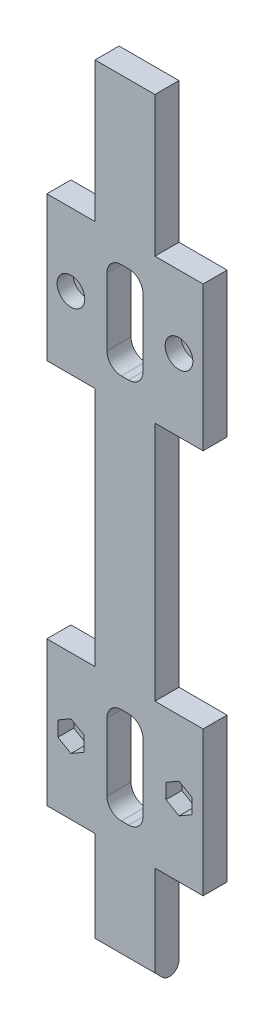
ISO-10303-21;
HEADER;
FILE_DESCRIPTION(('STEP AP214'),'2;1');
FILE_NAME('part.step','',(''),(''),'','','');
FILE_SCHEMA(('AUTOMOTIVE_DESIGN { 1 0 10303 214 1 1 1 1 }'));
ENDSEC;
DATA;
#1=APPLICATION_CONTEXT('core data for automotive mechanical design processes');
#2=APPLICATION_PROTOCOL_DEFINITION('international standard','automotive_design',2000,#1);
#3=PRODUCT_CONTEXT('',#1,'mechanical');
#4=PRODUCT('Part','Part','',(#3));
#5=PRODUCT_RELATED_PRODUCT_CATEGORY('part','',(#4));
#6=PRODUCT_DEFINITION_FORMATION('','',#4);
#7=PRODUCT_DEFINITION_CONTEXT('part definition',#1,'design');
#8=PRODUCT_DEFINITION('design','',#6,#7);
#9=PRODUCT_DEFINITION_SHAPE('','',#8);
#10=(LENGTH_UNIT() NAMED_UNIT(*) SI_UNIT(.MILLI.,.METRE.));
#11=(NAMED_UNIT(*) PLANE_ANGLE_UNIT() SI_UNIT($,.RADIAN.));
#12=(NAMED_UNIT(*) SI_UNIT($,.STERADIAN.) SOLID_ANGLE_UNIT());
#13=UNCERTAINTY_MEASURE_WITH_UNIT(LENGTH_MEASURE(1.E-05),#10,'distance_accuracy_value','');
#14=(GEOMETRIC_REPRESENTATION_CONTEXT(3) GLOBAL_UNCERTAINTY_ASSIGNED_CONTEXT((#13)) GLOBAL_UNIT_ASSIGNED_CONTEXT((#10,
#11,#12)) REPRESENTATION_CONTEXT('',''));
#15=CARTESIAN_POINT('',(0.,0.,0.));
#16=DIRECTION('',(0.,0.,1.));
#17=DIRECTION('',(1.,0.,0.));
#18=AXIS2_PLACEMENT_3D('',#15,#16,#17);
#19=CARTESIAN_POINT('',(-16.9782132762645,-16.2261839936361,-5.));
#20=DIRECTION('',(0.,0.,1.));
#21=DIRECTION('',(1.,0.,0.));
#22=AXIS2_PLACEMENT_3D('',#19,#20,#21);
#23=CYLINDRICAL_SURFACE('',#22,1.55);
#24=CARTESIAN_POINT('',(-16.9782132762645,-16.2261839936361,-5.));
#25=DIRECTION('',(0.,0.,1.));
#26=DIRECTION('',(1.,0.,0.));
#27=AXIS2_PLACEMENT_3D('',#24,#25,#26);
#28=CIRCLE('',#27,1.55);
#29=CARTESIAN_POINT('',(-15.4282132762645,-16.2261839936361,-5.));
#30=VERTEX_POINT('',#29);
#31=EDGE_CURVE('E460',#30,#30,#28,.T.);
#32=ORIENTED_EDGE('',*,*,#31,.F.);
#33=EDGE_LOOP('',(#32));
#34=FACE_BOUND('',#33,.T.);
#35=CARTESIAN_POINT('',(-16.9782132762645,-16.2261839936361,-3.3));
#36=DIRECTION('',(0.,0.,1.));
#37=DIRECTION('',(1.,0.,0.));
#38=AXIS2_PLACEMENT_3D('',#35,#36,#37);
#39=CIRCLE('',#38,1.55);
#40=CARTESIAN_POINT('',(-15.4282132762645,-16.2261839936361,-3.3));
#41=VERTEX_POINT('',#40);
#42=EDGE_CURVE('E467',#41,#41,#39,.F.);
#43=ORIENTED_EDGE('',*,*,#42,.F.);
#44=EDGE_LOOP('',(#43));
#45=FACE_BOUND('',#44,.T.);
#46=ADVANCED_FACE('F36',(#34,#45),#23,.F.);
#47=CARTESIAN_POINT('',(5.4531129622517,-16.2261839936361,-5.));
#48=DIRECTION('',(0.,0.,1.));
#49=DIRECTION('',(1.,0.,0.));
#50=AXIS2_PLACEMENT_3D('',#47,#48,#49);
#51=CYLINDRICAL_SURFACE('',#50,1.55);
#52=CARTESIAN_POINT('',(5.4531129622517,-16.2261839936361,-5.));
#53=DIRECTION('',(0.,0.,1.));
#54=DIRECTION('',(1.,0.,0.));
#55=AXIS2_PLACEMENT_3D('',#52,#53,#54);
#56=CIRCLE('',#55,1.55);
#57=CARTESIAN_POINT('',(7.0031129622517,-16.2261839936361,-5.));
#58=VERTEX_POINT('',#57);
#59=EDGE_CURVE('E457',#58,#58,#56,.T.);
#60=ORIENTED_EDGE('',*,*,#59,.F.);
#61=EDGE_LOOP('',(#60));
#62=FACE_BOUND('',#61,.T.);
#63=CARTESIAN_POINT('',(5.4531129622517,-16.2261839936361,-3.3));
#64=DIRECTION('',(0.,0.,1.));
#65=DIRECTION('',(1.,0.,0.));
#66=AXIS2_PLACEMENT_3D('',#63,#64,#65);
#67=CIRCLE('',#66,1.55);
#68=CARTESIAN_POINT('',(7.0031129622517,-16.2261839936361,-3.3));
#69=VERTEX_POINT('',#68);
#70=EDGE_CURVE('E641',#69,#69,#67,.F.);
#71=ORIENTED_EDGE('',*,*,#70,.F.);
#72=EDGE_LOOP('',(#71));
#73=FACE_BOUND('',#72,.T.);
#74=ADVANCED_FACE('F780',(#62,#73),#51,.F.);
#75=CARTESIAN_POINT('',(5.45311296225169,63.7738160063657,-5.));
#76=DIRECTION('',(0.,0.,1.));
#77=DIRECTION('',(1.,0.,0.));
#78=AXIS2_PLACEMENT_3D('',#75,#76,#77);
#79=CYLINDRICAL_SURFACE('',#78,1.55);
#80=CARTESIAN_POINT('',(5.45311296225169,63.7738160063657,-5.));
#81=DIRECTION('',(0.,0.,1.));
#82=DIRECTION('',(1.,0.,0.));
#83=AXIS2_PLACEMENT_3D('',#80,#81,#82);
#84=CIRCLE('',#83,1.55);
#85=CARTESIAN_POINT('',(7.00311296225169,63.7738160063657,-5.));
#86=VERTEX_POINT('',#85);
#87=EDGE_CURVE('E461',#86,#86,#84,.T.);
#88=ORIENTED_EDGE('',*,*,#87,.F.);
#89=EDGE_LOOP('',(#88));
#90=FACE_BOUND('',#89,.T.);
#91=CARTESIAN_POINT('',(5.45311296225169,63.7738160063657,-3.3));
#92=DIRECTION('',(0.,0.,1.));
#93=DIRECTION('',(1.,0.,0.));
#94=AXIS2_PLACEMENT_3D('',#91,#92,#93);
#95=CIRCLE('',#94,1.55);
#96=CARTESIAN_POINT('',(7.00311296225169,63.7738160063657,-3.3));
#97=VERTEX_POINT('',#96);
#98=EDGE_CURVE('E638',#97,#97,#95,.F.);
#99=ORIENTED_EDGE('',*,*,#98,.F.);
#100=EDGE_LOOP('',(#99));
#101=FACE_BOUND('',#100,.T.);
#102=ADVANCED_FACE('F786',(#90,#101),#79,.F.);
#103=CARTESIAN_POINT('',(-16.9782132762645,63.7738160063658,-5.));
#104=DIRECTION('',(0.,0.,1.));
#105=DIRECTION('',(1.,0.,0.));
#106=AXIS2_PLACEMENT_3D('',#103,#104,#105);
#107=CYLINDRICAL_SURFACE('',#106,1.55);
#108=CARTESIAN_POINT('',(-16.9782132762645,63.7738160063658,-5.));
#109=DIRECTION('',(0.,0.,1.));
#110=DIRECTION('',(1.,0.,0.));
#111=AXIS2_PLACEMENT_3D('',#108,#109,#110);
#112=CIRCLE('',#111,1.55);
#113=CARTESIAN_POINT('',(-15.4282132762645,63.7738160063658,-5.));
#114=VERTEX_POINT('',#113);
#115=EDGE_CURVE('E464',#114,#114,#112,.T.);
#116=ORIENTED_EDGE('',*,*,#115,.F.);
#117=EDGE_LOOP('',(#116));
#118=FACE_BOUND('',#117,.T.);
#119=CARTESIAN_POINT('',(-16.9782132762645,63.7738160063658,-3.3));
#120=DIRECTION('',(0.,0.,1.));
#121=DIRECTION('',(1.,0.,0.));
#122=AXIS2_PLACEMENT_3D('',#119,#120,#121);
#123=CIRCLE('',#122,1.55);
#124=CARTESIAN_POINT('',(-15.4282132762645,63.7738160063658,-3.3));
#125=VERTEX_POINT('',#124);
#126=EDGE_CURVE('E446',#125,#125,#123,.F.);
#127=ORIENTED_EDGE('',*,*,#126,.F.);
#128=EDGE_LOOP('',(#127));
#129=FACE_BOUND('',#128,.T.);
#130=ADVANCED_FACE('F793',(#118,#129),#107,.F.);
#131=CARTESIAN_POINT('',(-11.9782132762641,78.7738160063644,-5.));
#132=DIRECTION('',(0.,1.,0.));
#133=DIRECTION('',(0.,0.,1.));
#134=AXIS2_PLACEMENT_3D('',#131,#132,#133);
#135=PLANE('',#134);
#136=DIRECTION('',(-1.,0.,0.));
#137=VECTOR('',#136,1.);
#138=CARTESIAN_POINT('',(-11.9782132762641,78.7738160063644,0.));
#139=LINE('',#138,#137);
#140=CARTESIAN_POINT('',(-11.9782132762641,78.7738160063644,0.));
#141=VERTEX_POINT('',#140);
#142=CARTESIAN_POINT('',(-21.9782132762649,78.7738160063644,0.));
#143=VERTEX_POINT('',#142);
#144=EDGE_CURVE('E477',#141,#143,#139,.T.);
#145=ORIENTED_EDGE('',*,*,#144,.F.);
#146=DIRECTION('',(0.,0.,1.));
#147=VECTOR('',#146,1.);
#148=CARTESIAN_POINT('',(-11.9782132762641,78.7738160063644,-5.));
#149=LINE('',#148,#147);
#150=CARTESIAN_POINT('',(-11.9782132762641,78.7738160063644,-5.));
#151=VERTEX_POINT('',#150);
#152=EDGE_CURVE('E590',#151,#141,#149,.T.);
#153=ORIENTED_EDGE('',*,*,#152,.F.);
#154=DIRECTION('',(-1.,0.,0.));
#155=VECTOR('',#154,1.);
#156=CARTESIAN_POINT('',(-11.9782132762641,78.7738160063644,-5.));
#157=LINE('',#156,#155);
#158=CARTESIAN_POINT('',(-21.9782132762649,78.7738160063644,-5.));
#159=VERTEX_POINT('',#158);
#160=EDGE_CURVE('E478',#151,#159,#157,.T.);
#161=ORIENTED_EDGE('',*,*,#160,.T.);
#162=DIRECTION('',(0.,0.,1.));
#163=VECTOR('',#162,1.);
#164=CARTESIAN_POINT('',(-21.9782132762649,78.7738160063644,-5.));
#165=LINE('',#164,#163);
#166=EDGE_CURVE('E535',#159,#143,#165,.T.);
#167=ORIENTED_EDGE('',*,*,#166,.T.);
#168=EDGE_LOOP('',(#145,#153,#161,#167));
#169=FACE_BOUND('',#168,.T.);
#170=ADVANCED_FACE('F811',(#169),#135,.T.);
#171=CARTESIAN_POINT('',(-11.9782132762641,78.7738160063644,-5.));
#172=DIRECTION('',(-1.,0.,0.));
#173=DIRECTION('',(0.,0.,1.));
#174=AXIS2_PLACEMENT_3D('',#171,#172,#173);
#175=PLANE('',#174);
#176=DIRECTION('',(0.,-1.,0.));
#177=VECTOR('',#176,1.);
#178=CARTESIAN_POINT('',(-11.9782132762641,78.7738160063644,0.));
#179=LINE('',#178,#177);
#180=CARTESIAN_POINT('',(-11.9782132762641,107.842268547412,0.));
#181=VERTEX_POINT('',#180);
#182=EDGE_CURVE('E482',#181,#141,#179,.T.);
#183=ORIENTED_EDGE('',*,*,#182,.F.);
#184=DIRECTION('',(0.,0.,1.));
#185=VECTOR('',#184,1.);
#186=CARTESIAN_POINT('',(-11.9782132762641,107.842268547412,-5.));
#187=LINE('',#186,#185);
#188=CARTESIAN_POINT('',(-11.9782132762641,107.842268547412,-5.));
#189=VERTEX_POINT('',#188);
#190=EDGE_CURVE('E593',#189,#181,#187,.T.);
#191=ORIENTED_EDGE('',*,*,#190,.F.);
#192=DIRECTION('',(0.,-1.,0.));
#193=VECTOR('',#192,1.);
#194=CARTESIAN_POINT('',(-11.9782132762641,78.7738160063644,-5.));
#195=LINE('',#194,#193);
#196=EDGE_CURVE('E532',#189,#151,#195,.T.);
#197=ORIENTED_EDGE('',*,*,#196,.T.);
#198=ORIENTED_EDGE('',*,*,#152,.T.);
#199=EDGE_LOOP('',(#183,#191,#197,#198));
#200=FACE_BOUND('',#199,.T.);
#201=ADVANCED_FACE('F807',(#200),#175,.T.);
#202=CARTESIAN_POINT('',(-11.9782132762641,107.842268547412,-5.));
#203=DIRECTION('',(0.,1.,0.));
#204=DIRECTION('',(0.,0.,1.));
#205=AXIS2_PLACEMENT_3D('',#202,#203,#204);
#206=PLANE('',#205);
#207=DIRECTION('',(-1.,0.,0.));
#208=VECTOR('',#207,1.);
#209=CARTESIAN_POINT('',(-11.9782132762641,107.842268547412,0.));
#210=LINE('',#209,#208);
#211=CARTESIAN_POINT('',(0.453112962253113,107.842268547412,0.));
#212=VERTEX_POINT('',#211);
#213=EDGE_CURVE('E585',#212,#181,#210,.T.);
#214=ORIENTED_EDGE('',*,*,#213,.F.);
#215=DIRECTION('',(0.,0.,1.));
#216=VECTOR('',#215,1.);
#217=CARTESIAN_POINT('',(0.453112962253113,107.842268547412,-5.));
#218=LINE('',#217,#216);
#219=CARTESIAN_POINT('',(0.453112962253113,107.842268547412,-5.));
#220=VERTEX_POINT('',#219);
#221=EDGE_CURVE('E595',#220,#212,#218,.T.);
#222=ORIENTED_EDGE('',*,*,#221,.F.);
#223=DIRECTION('',(-1.,0.,0.));
#224=VECTOR('',#223,1.);
#225=CARTESIAN_POINT('',(-11.9782132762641,107.842268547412,-5.));
#226=LINE('',#225,#224);
#227=EDGE_CURVE('E529',#220,#189,#226,.T.);
#228=ORIENTED_EDGE('',*,*,#227,.T.);
#229=ORIENTED_EDGE('',*,*,#190,.T.);
#230=EDGE_LOOP('',(#214,#222,#228,#229));
#231=FACE_BOUND('',#230,.T.);
#232=ADVANCED_FACE('F810',(#231),#206,.T.);
#233=CARTESIAN_POINT('',(0.453112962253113,78.7738160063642,-5.));
#234=DIRECTION('',(1.,0.,0.));
#235=DIRECTION('',(0.,0.,-1.));
#236=AXIS2_PLACEMENT_3D('',#233,#234,#235);
#237=PLANE('',#236);
#238=DIRECTION('',(0.,1.,0.));
#239=VECTOR('',#238,1.);
#240=CARTESIAN_POINT('',(0.453112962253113,78.7738160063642,0.));
#241=LINE('',#240,#239);
#242=CARTESIAN_POINT('',(0.453112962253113,78.7738160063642,0.));
#243=VERTEX_POINT('',#242);
#244=EDGE_CURVE('E582',#243,#212,#241,.T.);
#245=ORIENTED_EDGE('',*,*,#244,.F.);
#246=DIRECTION('',(0.,0.,1.));
#247=VECTOR('',#246,1.);
#248=CARTESIAN_POINT('',(0.453112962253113,78.7738160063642,-5.));
#249=LINE('',#248,#247);
#250=CARTESIAN_POINT('',(0.453112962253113,78.7738160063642,-5.));
#251=VERTEX_POINT('',#250);
#252=EDGE_CURVE('E597',#251,#243,#249,.T.);
#253=ORIENTED_EDGE('',*,*,#252,.F.);
#254=DIRECTION('',(0.,1.,0.));
#255=VECTOR('',#254,1.);
#256=CARTESIAN_POINT('',(0.453112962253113,78.7738160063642,-5.));
#257=LINE('',#256,#255);
#258=EDGE_CURVE('E526',#251,#220,#257,.T.);
#259=ORIENTED_EDGE('',*,*,#258,.T.);
#260=ORIENTED_EDGE('',*,*,#221,.T.);
#261=EDGE_LOOP('',(#245,#253,#259,#260));
#262=FACE_BOUND('',#261,.T.);
#263=ADVANCED_FACE('F815',(#262),#237,.T.);
#264=CARTESIAN_POINT('',(10.4531129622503,78.7738160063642,-5.));
#265=DIRECTION('',(0.,1.,0.));
#266=DIRECTION('',(0.,0.,1.));
#267=AXIS2_PLACEMENT_3D('',#264,#265,#266);
#268=PLANE('',#267);
#269=DIRECTION('',(-1.,0.,0.));
#270=VECTOR('',#269,1.);
#271=CARTESIAN_POINT('',(10.4531129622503,78.7738160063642,0.));
#272=LINE('',#271,#270);
#273=CARTESIAN_POINT('',(10.4531129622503,78.7738160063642,0.));
#274=VERTEX_POINT('',#273);
#275=EDGE_CURVE('E579',#274,#243,#272,.T.);
#276=ORIENTED_EDGE('',*,*,#275,.F.);
#277=DIRECTION('',(0.,0.,1.));
#278=VECTOR('',#277,1.);
#279=CARTESIAN_POINT('',(10.4531129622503,78.7738160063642,-5.));
#280=LINE('',#279,#278);
#281=CARTESIAN_POINT('',(10.4531129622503,78.7738160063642,-5.));
#282=VERTEX_POINT('',#281);
#283=EDGE_CURVE('E599',#282,#274,#280,.T.);
#284=ORIENTED_EDGE('',*,*,#283,.F.);
#285=DIRECTION('',(-1.,0.,0.));
#286=VECTOR('',#285,1.);
#287=CARTESIAN_POINT('',(10.4531129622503,78.7738160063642,-5.));
#288=LINE('',#287,#286);
#289=EDGE_CURVE('E523',#282,#251,#288,.T.);
#290=ORIENTED_EDGE('',*,*,#289,.T.);
#291=ORIENTED_EDGE('',*,*,#252,.T.);
#292=EDGE_LOOP('',(#276,#284,#290,#291));
#293=FACE_BOUND('',#292,.T.);
#294=ADVANCED_FACE('F819',(#293),#268,.T.);
#295=CARTESIAN_POINT('',(10.4531129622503,48.7738160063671,-5.));
#296=DIRECTION('',(1.,0.,0.));
#297=DIRECTION('',(0.,1.,0.));
#298=AXIS2_PLACEMENT_3D('',#295,#296,#297);
#299=PLANE('',#298);
#300=DIRECTION('',(0.,1.,0.));
#301=VECTOR('',#300,1.);
#302=CARTESIAN_POINT('',(10.4531129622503,48.7738160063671,0.));
#303=LINE('',#302,#301);
#304=CARTESIAN_POINT('',(10.4531129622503,48.7738160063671,0.));
#305=VERTEX_POINT('',#304);
#306=EDGE_CURVE('E576',#305,#274,#303,.T.);
#307=ORIENTED_EDGE('',*,*,#306,.F.);
#308=DIRECTION('',(0.,0.,1.));
#309=VECTOR('',#308,1.);
#310=CARTESIAN_POINT('',(10.4531129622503,48.7738160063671,-5.));
#311=LINE('',#310,#309);
#312=CARTESIAN_POINT('',(10.4531129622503,48.7738160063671,-5.));
#313=VERTEX_POINT('',#312);
#314=EDGE_CURVE('E601',#313,#305,#311,.T.);
#315=ORIENTED_EDGE('',*,*,#314,.F.);
#316=DIRECTION('',(0.,1.,0.));
#317=VECTOR('',#316,1.);
#318=CARTESIAN_POINT('',(10.4531129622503,48.7738160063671,-5.));
#319=LINE('',#318,#317);
#320=EDGE_CURVE('E520',#313,#282,#319,.T.);
#321=ORIENTED_EDGE('',*,*,#320,.T.);
#322=ORIENTED_EDGE('',*,*,#283,.T.);
#323=EDGE_LOOP('',(#307,#315,#321,#322));
#324=FACE_BOUND('',#323,.T.);
#325=ADVANCED_FACE('F823',(#324),#299,.T.);
#326=CARTESIAN_POINT('',(0.45311296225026,48.7738160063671,-5.));
#327=DIRECTION('',(0.,-1.,0.));
#328=DIRECTION('',(1.,0.,0.));
#329=AXIS2_PLACEMENT_3D('',#326,#327,#328);
#330=PLANE('',#329);
#331=DIRECTION('',(1.,0.,0.));
#332=VECTOR('',#331,1.);
#333=CARTESIAN_POINT('',(0.45311296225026,48.7738160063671,0.));
#334=LINE('',#333,#332);
#335=CARTESIAN_POINT('',(0.45311296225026,48.7738160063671,0.));
#336=VERTEX_POINT('',#335);
#337=EDGE_CURVE('E573',#336,#305,#334,.T.);
#338=ORIENTED_EDGE('',*,*,#337,.F.);
#339=DIRECTION('',(0.,0.,1.));
#340=VECTOR('',#339,1.);
#341=CARTESIAN_POINT('',(0.45311296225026,48.7738160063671,-5.));
#342=LINE('',#341,#340);
#343=CARTESIAN_POINT('',(0.45311296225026,48.7738160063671,-5.));
#344=VERTEX_POINT('',#343);
#345=EDGE_CURVE('E603',#344,#336,#342,.T.);
#346=ORIENTED_EDGE('',*,*,#345,.F.);
#347=DIRECTION('',(1.,0.,0.));
#348=VECTOR('',#347,1.);
#349=CARTESIAN_POINT('',(0.45311296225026,48.7738160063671,-5.));
#350=LINE('',#349,#348);
#351=EDGE_CURVE('E517',#344,#313,#350,.T.);
#352=ORIENTED_EDGE('',*,*,#351,.T.);
#353=ORIENTED_EDGE('',*,*,#314,.T.);
#354=EDGE_LOOP('',(#338,#346,#352,#353));
#355=FACE_BOUND('',#354,.T.);
#356=ADVANCED_FACE('F827',(#355),#330,.T.);
#357=CARTESIAN_POINT('',(0.453112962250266,-1.22618399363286,-5.));
#358=DIRECTION('',(1.,0.,0.));
#359=DIRECTION('',(0.,1.,0.));
#360=AXIS2_PLACEMENT_3D('',#357,#358,#359);
#361=PLANE('',#360);
#362=DIRECTION('',(0.,1.,0.));
#363=VECTOR('',#362,1.);
#364=CARTESIAN_POINT('',(0.453112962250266,-1.22618399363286,0.));
#365=LINE('',#364,#363);
#366=CARTESIAN_POINT('',(0.453112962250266,-1.22618399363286,0.));
#367=VERTEX_POINT('',#366);
#368=EDGE_CURVE('E570',#367,#336,#365,.T.);
#369=ORIENTED_EDGE('',*,*,#368,.F.);
#370=DIRECTION('',(0.,0.,1.));
#371=VECTOR('',#370,1.);
#372=CARTESIAN_POINT('',(0.453112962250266,-1.22618399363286,-5.));
#373=LINE('',#372,#371);
#374=CARTESIAN_POINT('',(0.453112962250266,-1.22618399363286,-5.));
#375=VERTEX_POINT('',#374);
#376=EDGE_CURVE('E605',#375,#367,#373,.T.);
#377=ORIENTED_EDGE('',*,*,#376,.F.);
#378=DIRECTION('',(0.,1.,0.));
#379=VECTOR('',#378,1.);
#380=CARTESIAN_POINT('',(0.453112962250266,-1.22618399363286,-5.));
#381=LINE('',#380,#379);
#382=EDGE_CURVE('E514',#375,#344,#381,.T.);
#383=ORIENTED_EDGE('',*,*,#382,.T.);
#384=ORIENTED_EDGE('',*,*,#345,.T.);
#385=EDGE_LOOP('',(#369,#377,#383,#384));
#386=FACE_BOUND('',#385,.T.);
#387=ADVANCED_FACE('F831',(#386),#361,.T.);
#388=CARTESIAN_POINT('',(10.4531129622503,-1.22618399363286,-5.));
#389=DIRECTION('',(0.,1.,0.));
#390=DIRECTION('',(-1.,0.,0.));
#391=AXIS2_PLACEMENT_3D('',#388,#389,#390);
#392=PLANE('',#391);
#393=DIRECTION('',(-1.,0.,0.));
#394=VECTOR('',#393,1.);
#395=CARTESIAN_POINT('',(10.4531129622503,-1.22618399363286,0.));
#396=LINE('',#395,#394);
#397=CARTESIAN_POINT('',(10.4531129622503,-1.22618399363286,0.));
#398=VERTEX_POINT('',#397);
#399=EDGE_CURVE('E567',#398,#367,#396,.T.);
#400=ORIENTED_EDGE('',*,*,#399,.F.);
#401=DIRECTION('',(0.,0.,1.));
#402=VECTOR('',#401,1.);
#403=CARTESIAN_POINT('',(10.4531129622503,-1.22618399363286,-5.));
#404=LINE('',#403,#402);
#405=CARTESIAN_POINT('',(10.4531129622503,-1.22618399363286,-5.));
#406=VERTEX_POINT('',#405);
#407=EDGE_CURVE('E607',#406,#398,#404,.T.);
#408=ORIENTED_EDGE('',*,*,#407,.F.);
#409=DIRECTION('',(-1.,0.,0.));
#410=VECTOR('',#409,1.);
#411=CARTESIAN_POINT('',(10.4531129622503,-1.22618399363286,-5.));
#412=LINE('',#411,#410);
#413=EDGE_CURVE('E511',#406,#375,#412,.T.);
#414=ORIENTED_EDGE('',*,*,#413,.T.);
#415=ORIENTED_EDGE('',*,*,#376,.T.);
#416=EDGE_LOOP('',(#400,#408,#414,#415));
#417=FACE_BOUND('',#416,.T.);
#418=ADVANCED_FACE('F835',(#417),#392,.T.);
#419=CARTESIAN_POINT('',(10.4531129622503,-31.2261839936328,-5.));
#420=DIRECTION('',(1.,0.,0.));
#421=DIRECTION('',(0.,1.,0.));
#422=AXIS2_PLACEMENT_3D('',#419,#420,#421);
#423=PLANE('',#422);
#424=DIRECTION('',(0.,1.,0.));
#425=VECTOR('',#424,1.);
#426=CARTESIAN_POINT('',(10.4531129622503,-31.2261839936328,0.));
#427=LINE('',#426,#425);
#428=CARTESIAN_POINT('',(10.4531129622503,-31.2261839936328,0.));
#429=VERTEX_POINT('',#428);
#430=EDGE_CURVE('E564',#429,#398,#427,.T.);
#431=ORIENTED_EDGE('',*,*,#430,.F.);
#432=DIRECTION('',(0.,0.,1.));
#433=VECTOR('',#432,1.);
#434=CARTESIAN_POINT('',(10.4531129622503,-31.2261839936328,-5.));
#435=LINE('',#434,#433);
#436=CARTESIAN_POINT('',(10.4531129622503,-31.2261839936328,-5.));
#437=VERTEX_POINT('',#436);
#438=EDGE_CURVE('E609',#437,#429,#435,.T.);
#439=ORIENTED_EDGE('',*,*,#438,.F.);
#440=DIRECTION('',(0.,1.,0.));
#441=VECTOR('',#440,1.);
#442=CARTESIAN_POINT('',(10.4531129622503,-31.2261839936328,-5.));
#443=LINE('',#442,#441);
#444=EDGE_CURVE('E508',#437,#406,#443,.T.);
#445=ORIENTED_EDGE('',*,*,#444,.T.);
#446=ORIENTED_EDGE('',*,*,#407,.T.);
#447=EDGE_LOOP('',(#431,#439,#445,#446));
#448=FACE_BOUND('',#447,.T.);
#449=ADVANCED_FACE('F839',(#448),#423,.T.);
#450=CARTESIAN_POINT('',(0.453112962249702,-31.2261839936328,-5.));
#451=DIRECTION('',(0.,-1.,0.));
#452=DIRECTION('',(1.,0.,0.));
#453=AXIS2_PLACEMENT_3D('',#450,#451,#452);
#454=PLANE('',#453);
#455=DIRECTION('',(1.,0.,0.));
#456=VECTOR('',#455,1.);
#457=CARTESIAN_POINT('',(0.453112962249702,-31.2261839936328,0.));
#458=LINE('',#457,#456);
#459=CARTESIAN_POINT('',(0.453112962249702,-31.2261839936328,0.));
#460=VERTEX_POINT('',#459);
#461=EDGE_CURVE('E561',#460,#429,#458,.T.);
#462=ORIENTED_EDGE('',*,*,#461,.F.);
#463=DIRECTION('',(0.,0.,1.));
#464=VECTOR('',#463,1.);
#465=CARTESIAN_POINT('',(0.453112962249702,-31.2261839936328,-5.));
#466=LINE('',#465,#464);
#467=CARTESIAN_POINT('',(0.453112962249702,-31.2261839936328,-5.));
#468=VERTEX_POINT('',#467);
#469=EDGE_CURVE('E611',#468,#460,#466,.T.);
#470=ORIENTED_EDGE('',*,*,#469,.F.);
#471=DIRECTION('',(1.,0.,0.));
#472=VECTOR('',#471,1.);
#473=CARTESIAN_POINT('',(0.453112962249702,-31.2261839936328,-5.));
#474=LINE('',#473,#472);
#475=EDGE_CURVE('E505',#468,#437,#474,.T.);
#476=ORIENTED_EDGE('',*,*,#475,.T.);
#477=ORIENTED_EDGE('',*,*,#438,.T.);
#478=EDGE_LOOP('',(#462,#470,#476,#477));
#479=FACE_BOUND('',#478,.T.);
#480=ADVANCED_FACE('F843',(#479),#454,.T.);
#481=CARTESIAN_POINT('',(0.453112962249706,-65.0866636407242,-5.));
#482=DIRECTION('',(1.,0.,0.));
#483=DIRECTION('',(0.,1.,0.));
#484=AXIS2_PLACEMENT_3D('',#481,#482,#483);
#485=PLANE('',#484);
#486=DIRECTION('',(0.,0.707106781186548,0.707106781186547));
#487=VECTOR('',#486,1.);
#488=CARTESIAN_POINT('',(0.453112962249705,-60.0866636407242,-10.));
#489=LINE('',#488,#487);
#490=CARTESIAN_POINT('',(0.453112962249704,-51.6724500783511,-1.5857864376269));
#491=VERTEX_POINT('',#490);
#492=CARTESIAN_POINT('',(0.453112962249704,-50.0866636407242,0.));
#493=VERTEX_POINT('',#492);
#494=EDGE_CURVE('E475',#491,#493,#489,.T.);
#495=ORIENTED_EDGE('',*,*,#494,.F.);
#496=CARTESIAN_POINT('',(0.453112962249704,-50.258236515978,-3.));
#497=DIRECTION('',(1.,0.,0.));
#498=DIRECTION('',(0.,1.,0.));
#499=AXIS2_PLACEMENT_3D('',#496,#497,#498);
#500=CIRCLE('',#499,2.);
#501=CARTESIAN_POINT('',(0.453112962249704,-50.258236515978,-5.));
#502=VERTEX_POINT('',#501);
#503=EDGE_CURVE('E633',#491,#502,#500,.T.);
#504=ORIENTED_EDGE('',*,*,#503,.T.);
#505=DIRECTION('',(0.,1.,0.));
#506=VECTOR('',#505,1.);
#507=CARTESIAN_POINT('',(0.453112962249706,-65.0866636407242,-5.));
#508=LINE('',#507,#506);
#509=EDGE_CURVE('E503',#502,#468,#508,.T.);
#510=ORIENTED_EDGE('',*,*,#509,.T.);
#511=ORIENTED_EDGE('',*,*,#469,.T.);
#512=DIRECTION('',(0.,1.,0.));
#513=VECTOR('',#512,1.);
#514=CARTESIAN_POINT('',(0.453112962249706,-65.0866636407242,0.));
#515=LINE('',#514,#513);
#516=EDGE_CURVE('E559',#493,#460,#515,.T.);
#517=ORIENTED_EDGE('',*,*,#516,.F.);
#518=EDGE_LOOP('',(#495,#504,#510,#511,#517));
#519=FACE_BOUND('',#518,.T.);
#520=ADVANCED_FACE('F847',(#519),#485,.T.);
#521=CARTESIAN_POINT('',(-11.9782132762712,-65.0866636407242,-5.));
#522=DIRECTION('',(-1.,0.,0.));
#523=DIRECTION('',(0.,0.,1.));
#524=AXIS2_PLACEMENT_3D('',#521,#522,#523);
#525=PLANE('',#524);
#526=DIRECTION('',(0.,-1.,0.));
#527=VECTOR('',#526,1.);
#528=CARTESIAN_POINT('',(-11.9782132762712,-65.0866636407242,-5.));
#529=LINE('',#528,#527);
#530=CARTESIAN_POINT('',(-11.9782132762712,-31.2261839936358,-5.));
#531=VERTEX_POINT('',#530);
#532=CARTESIAN_POINT('',(-11.9782132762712,-50.258236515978,-5.));
#533=VERTEX_POINT('',#532);
#534=EDGE_CURVE('E500',#531,#533,#529,.T.);
#535=ORIENTED_EDGE('',*,*,#534,.T.);
#536=CARTESIAN_POINT('',(-11.9782132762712,-50.258236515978,-3.));
#537=DIRECTION('',(-1.,0.,0.));
#538=DIRECTION('',(0.,0.,1.));
#539=AXIS2_PLACEMENT_3D('',#536,#537,#538);
#540=CIRCLE('',#539,2.);
#541=CARTESIAN_POINT('',(-11.9782132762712,-51.6724500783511,-1.5857864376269));
#542=VERTEX_POINT('',#541);
#543=EDGE_CURVE('E629',#533,#542,#540,.T.);
#544=ORIENTED_EDGE('',*,*,#543,.T.);
#545=DIRECTION('',(0.,-0.707106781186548,-0.707106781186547));
#546=VECTOR('',#545,1.);
#547=CARTESIAN_POINT('',(-11.9782132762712,-65.0866636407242,-15.));
#548=LINE('',#547,#546);
#549=CARTESIAN_POINT('',(-11.9782132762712,-50.0866636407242,0.));
#550=VERTEX_POINT('',#549);
#551=EDGE_CURVE('E470',#550,#542,#548,.T.);
#552=ORIENTED_EDGE('',*,*,#551,.F.);
#553=DIRECTION('',(0.,-1.,0.));
#554=VECTOR('',#553,1.);
#555=CARTESIAN_POINT('',(-11.9782132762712,-65.0866636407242,0.));
#556=LINE('',#555,#554);
#557=CARTESIAN_POINT('',(-11.9782132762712,-31.2261839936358,0.));
#558=VERTEX_POINT('',#557);
#559=EDGE_CURVE('E556',#558,#550,#556,.T.);
#560=ORIENTED_EDGE('',*,*,#559,.F.);
#561=DIRECTION('',(0.,0.,1.));
#562=VECTOR('',#561,1.);
#563=CARTESIAN_POINT('',(-11.9782132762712,-31.2261839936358,-5.));
#564=LINE('',#563,#562);
#565=EDGE_CURVE('E614',#531,#558,#564,.T.);
#566=ORIENTED_EDGE('',*,*,#565,.F.);
#567=EDGE_LOOP('',(#535,#544,#552,#560,#566));
#568=FACE_BOUND('',#567,.T.);
#569=ADVANCED_FACE('F851',(#568),#525,.T.);
#570=CARTESIAN_POINT('',(-21.9782132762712,-31.2261839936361,-5.));
#571=DIRECTION('',(0.,-1.,0.));
#572=DIRECTION('',(1.,0.,0.));
#573=AXIS2_PLACEMENT_3D('',#570,#571,#572);
#574=PLANE('',#573);
#575=DIRECTION('',(1.,0.,0.));
#576=VECTOR('',#575,1.);
#577=CARTESIAN_POINT('',(-21.9782132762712,-31.2261839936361,0.));
#578=LINE('',#577,#576);
#579=CARTESIAN_POINT('',(-21.9782132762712,-31.2261839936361,0.));
#580=VERTEX_POINT('',#579);
#581=EDGE_CURVE('E553',#580,#558,#578,.T.);
#582=ORIENTED_EDGE('',*,*,#581,.F.);
#583=DIRECTION('',(0.,0.,1.));
#584=VECTOR('',#583,1.);
#585=CARTESIAN_POINT('',(-21.9782132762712,-31.2261839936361,-5.));
#586=LINE('',#585,#584);
#587=CARTESIAN_POINT('',(-21.9782132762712,-31.2261839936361,-5.));
#588=VERTEX_POINT('',#587);
#589=EDGE_CURVE('E616',#588,#580,#586,.T.);
#590=ORIENTED_EDGE('',*,*,#589,.F.);
#591=DIRECTION('',(1.,0.,0.));
#592=VECTOR('',#591,1.);
#593=CARTESIAN_POINT('',(-21.9782132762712,-31.2261839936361,-5.));
#594=LINE('',#593,#592);
#595=EDGE_CURVE('E497',#588,#531,#594,.T.);
#596=ORIENTED_EDGE('',*,*,#595,.T.);
#597=ORIENTED_EDGE('',*,*,#565,.T.);
#598=EDGE_LOOP('',(#582,#590,#596,#597));
#599=FACE_BOUND('',#598,.T.);
#600=ADVANCED_FACE('F855',(#599),#574,.T.);
#601=CARTESIAN_POINT('',(-21.9782132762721,-1.22618399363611,-5.));
#602=DIRECTION('',(-1.,0.,0.));
#603=DIRECTION('',(0.,-1.,0.));
#604=AXIS2_PLACEMENT_3D('',#601,#602,#603);
#605=PLANE('',#604);
#606=DIRECTION('',(0.,-1.,0.));
#607=VECTOR('',#606,1.);
#608=CARTESIAN_POINT('',(-21.9782132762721,-1.22618399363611,0.));
#609=LINE('',#608,#607);
#610=CARTESIAN_POINT('',(-21.9782132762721,-1.22618399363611,0.));
#611=VERTEX_POINT('',#610);
#612=EDGE_CURVE('E550',#611,#580,#609,.T.);
#613=ORIENTED_EDGE('',*,*,#612,.F.);
#614=DIRECTION('',(0.,0.,1.));
#615=VECTOR('',#614,1.);
#616=CARTESIAN_POINT('',(-21.9782132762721,-1.22618399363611,-5.));
#617=LINE('',#616,#615);
#618=CARTESIAN_POINT('',(-21.9782132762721,-1.22618399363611,-5.));
#619=VERTEX_POINT('',#618);
#620=EDGE_CURVE('E618',#619,#611,#617,.T.);
#621=ORIENTED_EDGE('',*,*,#620,.F.);
#622=DIRECTION('',(0.,-1.,0.));
#623=VECTOR('',#622,1.);
#624=CARTESIAN_POINT('',(-21.9782132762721,-1.22618399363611,-5.));
#625=LINE('',#624,#623);
#626=EDGE_CURVE('E494',#619,#588,#625,.T.);
#627=ORIENTED_EDGE('',*,*,#626,.T.);
#628=ORIENTED_EDGE('',*,*,#589,.T.);
#629=EDGE_LOOP('',(#613,#621,#627,#628));
#630=FACE_BOUND('',#629,.T.);
#631=ADVANCED_FACE('F859',(#630),#605,.T.);
#632=CARTESIAN_POINT('',(-11.9782132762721,-1.22618399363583,-5.));
#633=DIRECTION('',(0.,1.,0.));
#634=DIRECTION('',(-1.,0.,0.));
#635=AXIS2_PLACEMENT_3D('',#632,#633,#634);
#636=PLANE('',#635);
#637=DIRECTION('',(-1.,0.,0.));
#638=VECTOR('',#637,1.);
#639=CARTESIAN_POINT('',(-11.9782132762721,-1.22618399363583,0.));
#640=LINE('',#639,#638);
#641=CARTESIAN_POINT('',(-11.9782132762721,-1.22618399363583,0.));
#642=VERTEX_POINT('',#641);
#643=EDGE_CURVE('E547',#642,#611,#640,.T.);
#644=ORIENTED_EDGE('',*,*,#643,.F.);
#645=DIRECTION('',(0.,0.,1.));
#646=VECTOR('',#645,1.);
#647=CARTESIAN_POINT('',(-11.9782132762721,-1.22618399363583,-5.));
#648=LINE('',#647,#646);
#649=CARTESIAN_POINT('',(-11.9782132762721,-1.22618399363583,-5.));
#650=VERTEX_POINT('',#649);
#651=EDGE_CURVE('E620',#650,#642,#648,.T.);
#652=ORIENTED_EDGE('',*,*,#651,.F.);
#653=DIRECTION('',(-1.,0.,0.));
#654=VECTOR('',#653,1.);
#655=CARTESIAN_POINT('',(-11.9782132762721,-1.22618399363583,-5.));
#656=LINE('',#655,#654);
#657=EDGE_CURVE('E491',#650,#619,#656,.T.);
#658=ORIENTED_EDGE('',*,*,#657,.T.);
#659=ORIENTED_EDGE('',*,*,#620,.T.);
#660=EDGE_LOOP('',(#644,#652,#658,#659));
#661=FACE_BOUND('',#660,.T.);
#662=ADVANCED_FACE('F863',(#661),#636,.T.);
#663=CARTESIAN_POINT('',(-11.9782132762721,-1.22618399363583,-5.));
#664=DIRECTION('',(-1.,0.,0.));
#665=DIRECTION('',(0.,-1.,0.));
#666=AXIS2_PLACEMENT_3D('',#663,#664,#665);
#667=PLANE('',#666);
#668=DIRECTION('',(0.,-1.,0.));
#669=VECTOR('',#668,1.);
#670=CARTESIAN_POINT('',(-11.9782132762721,-1.22618399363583,0.));
#671=LINE('',#670,#669);
#672=CARTESIAN_POINT('',(-11.9782132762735,48.7738160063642,0.));
#673=VERTEX_POINT('',#672);
#674=EDGE_CURVE('E544',#673,#642,#671,.T.);
#675=ORIENTED_EDGE('',*,*,#674,.F.);
#676=DIRECTION('',(0.,0.,1.));
#677=VECTOR('',#676,1.);
#678=CARTESIAN_POINT('',(-11.9782132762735,48.7738160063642,-5.));
#679=LINE('',#678,#677);
#680=CARTESIAN_POINT('',(-11.9782132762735,48.7738160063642,-5.));
#681=VERTEX_POINT('',#680);
#682=EDGE_CURVE('E622',#681,#673,#679,.T.);
#683=ORIENTED_EDGE('',*,*,#682,.F.);
#684=DIRECTION('',(0.,-1.,0.));
#685=VECTOR('',#684,1.);
#686=CARTESIAN_POINT('',(-11.9782132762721,-1.22618399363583,-5.));
#687=LINE('',#686,#685);
#688=EDGE_CURVE('E488',#681,#650,#687,.T.);
#689=ORIENTED_EDGE('',*,*,#688,.T.);
#690=ORIENTED_EDGE('',*,*,#651,.T.);
#691=EDGE_LOOP('',(#675,#683,#689,#690));
#692=FACE_BOUND('',#691,.T.);
#693=ADVANCED_FACE('F867',(#692),#667,.T.);
#694=CARTESIAN_POINT('',(-21.9782132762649,48.7738160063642,-5.));
#695=DIRECTION('',(0.,-1.,0.));
#696=DIRECTION('',(0.,0.,-1.));
#697=AXIS2_PLACEMENT_3D('',#694,#695,#696);
#698=PLANE('',#697);
#699=DIRECTION('',(1.,0.,0.));
#700=VECTOR('',#699,1.);
#701=CARTESIAN_POINT('',(-21.9782132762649,48.7738160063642,0.));
#702=LINE('',#701,#700);
#703=CARTESIAN_POINT('',(-21.9782132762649,48.7738160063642,0.));
#704=VERTEX_POINT('',#703);
#705=EDGE_CURVE('E541',#704,#673,#702,.T.);
#706=ORIENTED_EDGE('',*,*,#705,.F.);
#707=DIRECTION('',(0.,0.,1.));
#708=VECTOR('',#707,1.);
#709=CARTESIAN_POINT('',(-21.9782132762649,48.7738160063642,-5.));
#710=LINE('',#709,#708);
#711=CARTESIAN_POINT('',(-21.9782132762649,48.7738160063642,-5.));
#712=VERTEX_POINT('',#711);
#713=EDGE_CURVE('E624',#712,#704,#710,.T.);
#714=ORIENTED_EDGE('',*,*,#713,.F.);
#715=DIRECTION('',(1.,0.,0.));
#716=VECTOR('',#715,1.);
#717=CARTESIAN_POINT('',(-21.9782132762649,48.7738160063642,-5.));
#718=LINE('',#717,#716);
#719=EDGE_CURVE('E485',#712,#681,#718,.T.);
#720=ORIENTED_EDGE('',*,*,#719,.T.);
#721=ORIENTED_EDGE('',*,*,#682,.T.);
#722=EDGE_LOOP('',(#706,#714,#720,#721));
#723=FACE_BOUND('',#722,.T.);
#724=ADVANCED_FACE('F871',(#723),#698,.T.);
#725=CARTESIAN_POINT('',(-21.9782132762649,78.7738160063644,-5.));
#726=DIRECTION('',(-1.,0.,0.));
#727=DIRECTION('',(0.,0.,1.));
#728=AXIS2_PLACEMENT_3D('',#725,#726,#727);
#729=PLANE('',#728);
#730=DIRECTION('',(0.,-1.,0.));
#731=VECTOR('',#730,1.);
#732=CARTESIAN_POINT('',(-21.9782132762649,78.7738160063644,0.));
#733=LINE('',#732,#731);
#734=EDGE_CURVE('E538',#143,#704,#733,.T.);
#735=ORIENTED_EDGE('',*,*,#734,.F.);
#736=ORIENTED_EDGE('',*,*,#166,.F.);
#737=DIRECTION('',(0.,-1.,0.));
#738=VECTOR('',#737,1.);
#739=CARTESIAN_POINT('',(-21.9782132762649,78.7738160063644,-5.));
#740=LINE('',#739,#738);
#741=EDGE_CURVE('E481',#159,#712,#740,.T.);
#742=ORIENTED_EDGE('',*,*,#741,.T.);
#743=ORIENTED_EDGE('',*,*,#713,.T.);
#744=EDGE_LOOP('',(#735,#736,#742,#743));
#745=FACE_BOUND('',#744,.T.);
#746=ADVANCED_FACE('F802',(#745),#729,.T.);
#747=CARTESIAN_POINT('',(0.,0.,-5.));
#748=DIRECTION('',(0.,0.,1.));
#749=DIRECTION('',(1.,0.,0.));
#750=AXIS2_PLACEMENT_3D('',#747,#748,#749);
#751=PLANE('',#750);
#752=DIRECTION('',(0.,1.,0.));
#753=VECTOR('',#752,1.);
#754=CARTESIAN_POINT('',(-2.01255015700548,-6.22618399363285,-5.));
#755=LINE('',#754,#753);
#756=CARTESIAN_POINT('',(-2.01255015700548,-23.2261839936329,-5.));
#757=VERTEX_POINT('',#756);
#758=CARTESIAN_POINT('',(-2.01255015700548,-9.22618399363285,-5.));
#759=VERTEX_POINT('',#758);
#760=EDGE_CURVE('E1579',#757,#759,#755,.T.);
#761=ORIENTED_EDGE('',*,*,#760,.T.);
#762=CARTESIAN_POINT('',(-5.01255015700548,-9.22618399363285,-5.));
#763=DIRECTION('',(0.,0.,1.));
#764=DIRECTION('',(1.,0.,0.));
#765=AXIS2_PLACEMENT_3D('',#762,#763,#764);
#766=CIRCLE('',#765,3.);
#767=CARTESIAN_POINT('',(-5.01255015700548,-6.22618399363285,-5.));
#768=VERTEX_POINT('',#767);
#769=EDGE_CURVE('E690',#759,#768,#766,.T.);
#770=ORIENTED_EDGE('',*,*,#769,.T.);
#771=DIRECTION('',(-1.,0.,0.));
#772=VECTOR('',#771,1.);
#773=CARTESIAN_POINT('',(-9.5125501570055,-6.22618399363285,-5.));
#774=LINE('',#773,#772);
#775=CARTESIAN_POINT('',(-6.5125501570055,-6.22618399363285,-5.));
#776=VERTEX_POINT('',#775);
#777=EDGE_CURVE('E410',#768,#776,#774,.T.);
#778=ORIENTED_EDGE('',*,*,#777,.T.);
#779=CARTESIAN_POINT('',(-6.5125501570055,-9.22618399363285,-5.));
#780=DIRECTION('',(0.,0.,1.));
#781=DIRECTION('',(1.,0.,0.));
#782=AXIS2_PLACEMENT_3D('',#779,#780,#781);
#783=CIRCLE('',#782,3.);
#784=CARTESIAN_POINT('',(-9.5125501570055,-9.22618399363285,-5.));
#785=VERTEX_POINT('',#784);
#786=EDGE_CURVE('E686',#776,#785,#783,.T.);
#787=ORIENTED_EDGE('',*,*,#786,.T.);
#788=DIRECTION('',(0.,-1.,0.));
#789=VECTOR('',#788,1.);
#790=CARTESIAN_POINT('',(-9.5125501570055,-6.22618399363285,-5.));
#791=LINE('',#790,#789);
#792=CARTESIAN_POINT('',(-9.5125501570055,-23.2261839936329,-5.));
#793=VERTEX_POINT('',#792);
#794=EDGE_CURVE('E1588',#785,#793,#791,.T.);
#795=ORIENTED_EDGE('',*,*,#794,.T.);
#796=CARTESIAN_POINT('',(-6.5125501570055,-23.2261839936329,-5.));
#797=DIRECTION('',(0.,0.,1.));
#798=DIRECTION('',(1.,0.,0.));
#799=AXIS2_PLACEMENT_3D('',#796,#797,#798);
#800=CIRCLE('',#799,3.);
#801=CARTESIAN_POINT('',(-6.5125501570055,-26.2261839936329,-5.));
#802=VERTEX_POINT('',#801);
#803=EDGE_CURVE('E698',#793,#802,#800,.T.);
#804=ORIENTED_EDGE('',*,*,#803,.T.);
#805=DIRECTION('',(1.,0.,0.));
#806=VECTOR('',#805,1.);
#807=CARTESIAN_POINT('',(-9.5125501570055,-26.2261839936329,-5.));
#808=LINE('',#807,#806);
#809=CARTESIAN_POINT('',(-5.01255015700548,-26.2261839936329,-5.));
#810=VERTEX_POINT('',#809);
#811=EDGE_CURVE('E1581',#802,#810,#808,.T.);
#812=ORIENTED_EDGE('',*,*,#811,.T.);
#813=CARTESIAN_POINT('',(-5.01255015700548,-23.2261839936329,-5.));
#814=DIRECTION('',(0.,0.,1.));
#815=DIRECTION('',(1.,0.,0.));
#816=AXIS2_PLACEMENT_3D('',#813,#814,#815);
#817=CIRCLE('',#816,3.);
#818=EDGE_CURVE('E694',#810,#757,#817,.T.);
#819=ORIENTED_EDGE('',*,*,#818,.T.);
#820=EDGE_LOOP('',(#761,#770,#778,#787,#795,#804,#812,#819));
#821=FACE_BOUND('',#820,.T.);
#822=DIRECTION('',(0.,1.,0.));
#823=VECTOR('',#822,1.);
#824=CARTESIAN_POINT('',(-2.01255015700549,73.7738160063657,-5.));
#825=LINE('',#824,#823);
#826=CARTESIAN_POINT('',(-2.01255015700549,56.7738160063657,-5.));
#827=VERTEX_POINT('',#826);
#828=CARTESIAN_POINT('',(-2.01255015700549,70.7738160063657,-5.));
#829=VERTEX_POINT('',#828);
#830=EDGE_CURVE('E737',#827,#829,#825,.T.);
#831=ORIENTED_EDGE('',*,*,#830,.T.);
#832=CARTESIAN_POINT('',(-5.01255015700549,70.7738160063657,-5.));
#833=DIRECTION('',(0.,0.,1.));
#834=DIRECTION('',(1.,0.,0.));
#835=AXIS2_PLACEMENT_3D('',#832,#833,#834);
#836=CIRCLE('',#835,3.);
#837=CARTESIAN_POINT('',(-5.01255015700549,73.7738160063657,-5.));
#838=VERTEX_POINT('',#837);
#839=EDGE_CURVE('E58',#829,#838,#836,.T.);
#840=ORIENTED_EDGE('',*,*,#839,.T.);
#841=DIRECTION('',(-1.,0.,0.));
#842=VECTOR('',#841,1.);
#843=CARTESIAN_POINT('',(-9.51255015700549,73.7738160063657,-5.));
#844=LINE('',#843,#842);
#845=CARTESIAN_POINT('',(-6.51255015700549,73.7738160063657,-5.));
#846=VERTEX_POINT('',#845);
#847=EDGE_CURVE('E730',#838,#846,#844,.T.);
#848=ORIENTED_EDGE('',*,*,#847,.T.);
#849=CARTESIAN_POINT('',(-6.51255015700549,70.7738160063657,-5.));
#850=DIRECTION('',(0.,0.,1.));
#851=DIRECTION('',(1.,0.,0.));
#852=AXIS2_PLACEMENT_3D('',#849,#850,#851);
#853=CIRCLE('',#852,3.);
#854=CARTESIAN_POINT('',(-9.51255015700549,70.7738160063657,-5.));
#855=VERTEX_POINT('',#854);
#856=EDGE_CURVE('E11',#846,#855,#853,.T.);
#857=ORIENTED_EDGE('',*,*,#856,.T.);
#858=DIRECTION('',(0.,-1.,0.));
#859=VECTOR('',#858,1.);
#860=CARTESIAN_POINT('',(-9.51255015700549,73.7738160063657,-5.));
#861=LINE('',#860,#859);
#862=CARTESIAN_POINT('',(-9.51255015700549,56.7738160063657,-5.));
#863=VERTEX_POINT('',#862);
#864=EDGE_CURVE('E722',#855,#863,#861,.T.);
#865=ORIENTED_EDGE('',*,*,#864,.T.);
#866=CARTESIAN_POINT('',(-6.51255015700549,56.7738160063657,-5.));
#867=DIRECTION('',(0.,0.,1.));
#868=DIRECTION('',(1.,0.,0.));
#869=AXIS2_PLACEMENT_3D('',#866,#867,#868);
#870=CIRCLE('',#869,3.);
#871=CARTESIAN_POINT('',(-6.51255015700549,53.7738160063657,-5.));
#872=VERTEX_POINT('',#871);
#873=EDGE_CURVE('E702',#863,#872,#870,.T.);
#874=ORIENTED_EDGE('',*,*,#873,.T.);
#875=DIRECTION('',(1.,0.,0.));
#876=VECTOR('',#875,1.);
#877=CARTESIAN_POINT('',(-9.51255015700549,53.7738160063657,-5.));
#878=LINE('',#877,#876);
#879=CARTESIAN_POINT('',(-5.01255015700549,53.7738160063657,-5.));
#880=VERTEX_POINT('',#879);
#881=EDGE_CURVE('E734',#872,#880,#878,.T.);
#882=ORIENTED_EDGE('',*,*,#881,.T.);
#883=CARTESIAN_POINT('',(-5.01255015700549,56.7738160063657,-5.));
#884=DIRECTION('',(0.,0.,1.));
#885=DIRECTION('',(1.,0.,0.));
#886=AXIS2_PLACEMENT_3D('',#883,#884,#885);
#887=CIRCLE('',#886,3.);
#888=EDGE_CURVE('E706',#880,#827,#887,.T.);
#889=ORIENTED_EDGE('',*,*,#888,.T.);
#890=EDGE_LOOP('',(#831,#840,#848,#857,#865,#874,#882,#889));
#891=FACE_BOUND('',#890,.T.);
#892=ORIENTED_EDGE('',*,*,#115,.T.);
#893=EDGE_LOOP('',(#892));
#894=FACE_BOUND('',#893,.T.);
#895=ORIENTED_EDGE('',*,*,#87,.T.);
#896=EDGE_LOOP('',(#895));
#897=FACE_BOUND('',#896,.T.);
#898=ORIENTED_EDGE('',*,*,#59,.T.);
#899=EDGE_LOOP('',(#898));
#900=FACE_BOUND('',#899,.T.);
#901=ORIENTED_EDGE('',*,*,#31,.T.);
#902=EDGE_LOOP('',(#901));
#903=FACE_BOUND('',#902,.T.);
#904=ORIENTED_EDGE('',*,*,#509,.F.);
#905=DIRECTION('',(-1.,0.,0.));
#906=VECTOR('',#905,1.);
#907=CARTESIAN_POINT('',(0.,-50.258236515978,-5.));
#908=LINE('',#907,#906);
#909=EDGE_CURVE('E592',#502,#533,#908,.T.);
#910=ORIENTED_EDGE('',*,*,#909,.T.);
#911=ORIENTED_EDGE('',*,*,#534,.F.);
#912=ORIENTED_EDGE('',*,*,#595,.F.);
#913=ORIENTED_EDGE('',*,*,#626,.F.);
#914=ORIENTED_EDGE('',*,*,#657,.F.);
#915=ORIENTED_EDGE('',*,*,#688,.F.);
#916=ORIENTED_EDGE('',*,*,#719,.F.);
#917=ORIENTED_EDGE('',*,*,#741,.F.);
#918=ORIENTED_EDGE('',*,*,#160,.F.);
#919=ORIENTED_EDGE('',*,*,#196,.F.);
#920=ORIENTED_EDGE('',*,*,#227,.F.);
#921=ORIENTED_EDGE('',*,*,#258,.F.);
#922=ORIENTED_EDGE('',*,*,#289,.F.);
#923=ORIENTED_EDGE('',*,*,#320,.F.);
#924=ORIENTED_EDGE('',*,*,#351,.F.);
#925=ORIENTED_EDGE('',*,*,#382,.F.);
#926=ORIENTED_EDGE('',*,*,#413,.F.);
#927=ORIENTED_EDGE('',*,*,#444,.F.);
#928=ORIENTED_EDGE('',*,*,#475,.F.);
#929=EDGE_LOOP('',(#904,#910,#911,#912,#913,#914,#915,#916,#917,#918,#919,#920,#921,#922,#923,
#924,#925,#926,#927,#928));
#930=FACE_BOUND('',#929,.T.);
#931=ADVANCED_FACE('F727',(#821,#891,#894,#897,#900,#903,#930),#751,.F.);
#932=CARTESIAN_POINT('',(0.,0.,0.));
#933=DIRECTION('',(0.,0.,1.));
#934=DIRECTION('',(1.,0.,0.));
#935=AXIS2_PLACEMENT_3D('',#932,#933,#934);
#936=PLANE('',#935);
#937=DIRECTION('',(0.,-1.,0.));
#938=VECTOR('',#937,1.);
#939=CARTESIAN_POINT('',(-9.5125501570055,-6.22618399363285,0.));
#940=LINE('',#939,#938);
#941=CARTESIAN_POINT('',(-9.5125501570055,-9.22618399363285,0.));
#942=VERTEX_POINT('',#941);
#943=CARTESIAN_POINT('',(-9.5125501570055,-23.2261839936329,0.));
#944=VERTEX_POINT('',#943);
#945=EDGE_CURVE('E930',#942,#944,#940,.T.);
#946=ORIENTED_EDGE('',*,*,#945,.F.);
#947=CARTESIAN_POINT('',(-6.5125501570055,-9.22618399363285,0.));
#948=DIRECTION('',(0.,0.,1.));
#949=DIRECTION('',(1.,0.,0.));
#950=AXIS2_PLACEMENT_3D('',#947,#948,#949);
#951=CIRCLE('',#950,3.);
#952=CARTESIAN_POINT('',(-6.5125501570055,-6.22618399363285,0.));
#953=VERTEX_POINT('',#952);
#954=EDGE_CURVE('E684',#942,#953,#951,.F.);
#955=ORIENTED_EDGE('',*,*,#954,.T.);
#956=DIRECTION('',(-1.,0.,0.));
#957=VECTOR('',#956,1.);
#958=CARTESIAN_POINT('',(-9.5125501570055,-6.22618399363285,0.));
#959=LINE('',#958,#957);
#960=CARTESIAN_POINT('',(-5.01255015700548,-6.22618399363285,0.));
#961=VERTEX_POINT('',#960);
#962=EDGE_CURVE('E1594',#961,#953,#959,.T.);
#963=ORIENTED_EDGE('',*,*,#962,.F.);
#964=CARTESIAN_POINT('',(-5.01255015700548,-9.22618399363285,0.));
#965=DIRECTION('',(0.,0.,1.));
#966=DIRECTION('',(1.,0.,0.));
#967=AXIS2_PLACEMENT_3D('',#964,#965,#966);
#968=CIRCLE('',#967,3.);
#969=CARTESIAN_POINT('',(-2.01255015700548,-9.22618399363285,0.));
#970=VERTEX_POINT('',#969);
#971=EDGE_CURVE('E688',#961,#970,#968,.F.);
#972=ORIENTED_EDGE('',*,*,#971,.T.);
#973=DIRECTION('',(0.,1.,0.));
#974=VECTOR('',#973,1.);
#975=CARTESIAN_POINT('',(-2.01255015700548,-6.22618399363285,0.));
#976=LINE('',#975,#974);
#977=CARTESIAN_POINT('',(-2.01255015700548,-23.2261839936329,0.));
#978=VERTEX_POINT('',#977);
#979=EDGE_CURVE('E1573',#978,#970,#976,.T.);
#980=ORIENTED_EDGE('',*,*,#979,.F.);
#981=CARTESIAN_POINT('',(-5.01255015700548,-23.2261839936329,0.));
#982=DIRECTION('',(0.,0.,1.));
#983=DIRECTION('',(1.,0.,0.));
#984=AXIS2_PLACEMENT_3D('',#981,#982,#983);
#985=CIRCLE('',#984,3.);
#986=CARTESIAN_POINT('',(-5.01255015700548,-26.2261839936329,0.));
#987=VERTEX_POINT('',#986);
#988=EDGE_CURVE('E692',#978,#987,#985,.F.);
#989=ORIENTED_EDGE('',*,*,#988,.T.);
#990=DIRECTION('',(1.,0.,0.));
#991=VECTOR('',#990,1.);
#992=CARTESIAN_POINT('',(-9.5125501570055,-26.2261839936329,0.));
#993=LINE('',#992,#991);
#994=CARTESIAN_POINT('',(-6.5125501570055,-26.2261839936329,0.));
#995=VERTEX_POINT('',#994);
#996=EDGE_CURVE('E1568',#995,#987,#993,.T.);
#997=ORIENTED_EDGE('',*,*,#996,.F.);
#998=CARTESIAN_POINT('',(-6.5125501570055,-23.2261839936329,0.));
#999=DIRECTION('',(0.,0.,1.));
#1000=DIRECTION('',(1.,0.,0.));
#1001=AXIS2_PLACEMENT_3D('',#998,#999,#1000);
#1002=CIRCLE('',#1001,3.);
#1003=EDGE_CURVE('E696',#995,#944,#1002,.F.);
#1004=ORIENTED_EDGE('',*,*,#1003,.T.);
#1005=EDGE_LOOP('',(#946,#955,#963,#972,#980,#989,#997,#1004));
#1006=FACE_BOUND('',#1005,.T.);
#1007=DIRECTION('',(0.,-1.,0.));
#1008=VECTOR('',#1007,1.);
#1009=CARTESIAN_POINT('',(-9.51255015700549,73.7738160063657,0.));
#1010=LINE('',#1009,#1008);
#1011=CARTESIAN_POINT('',(-9.51255015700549,70.7738160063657,0.));
#1012=VERTEX_POINT('',#1011);
#1013=CARTESIAN_POINT('',(-9.51255015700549,56.7738160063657,0.));
#1014=VERTEX_POINT('',#1013);
#1015=EDGE_CURVE('E716',#1012,#1014,#1010,.T.);
#1016=ORIENTED_EDGE('',*,*,#1015,.F.);
#1017=CARTESIAN_POINT('',(-6.51255015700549,70.7738160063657,0.));
#1018=DIRECTION('',(0.,0.,1.));
#1019=DIRECTION('',(1.,0.,0.));
#1020=AXIS2_PLACEMENT_3D('',#1017,#1018,#1019);
#1021=CIRCLE('',#1020,3.);
#1022=CARTESIAN_POINT('',(-6.51255015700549,73.7738160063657,0.));
#1023=VERTEX_POINT('',#1022);
#1024=EDGE_CURVE('E44',#1012,#1023,#1021,.F.);
#1025=ORIENTED_EDGE('',*,*,#1024,.T.);
#1026=DIRECTION('',(-1.,0.,0.));
#1027=VECTOR('',#1026,1.);
#1028=CARTESIAN_POINT('',(-9.51255015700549,73.7738160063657,0.));
#1029=LINE('',#1028,#1027);
#1030=CARTESIAN_POINT('',(-5.01255015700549,73.7738160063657,0.));
#1031=VERTEX_POINT('',#1030);
#1032=EDGE_CURVE('E714',#1031,#1023,#1029,.T.);
#1033=ORIENTED_EDGE('',*,*,#1032,.F.);
#1034=CARTESIAN_POINT('',(-5.01255015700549,70.7738160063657,0.));
#1035=DIRECTION('',(0.,0.,1.));
#1036=DIRECTION('',(1.,0.,0.));
#1037=AXIS2_PLACEMENT_3D('',#1034,#1035,#1036);
#1038=CIRCLE('',#1037,3.);
#1039=CARTESIAN_POINT('',(-2.01255015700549,70.7738160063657,0.));
#1040=VERTEX_POINT('',#1039);
#1041=EDGE_CURVE('E708',#1031,#1040,#1038,.F.);
#1042=ORIENTED_EDGE('',*,*,#1041,.T.);
#1043=DIRECTION('',(0.,1.,0.));
#1044=VECTOR('',#1043,1.);
#1045=CARTESIAN_POINT('',(-2.01255015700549,73.7738160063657,0.));
#1046=LINE('',#1045,#1044);
#1047=CARTESIAN_POINT('',(-2.01255015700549,56.7738160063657,0.));
#1048=VERTEX_POINT('',#1047);
#1049=EDGE_CURVE('E721',#1048,#1040,#1046,.T.);
#1050=ORIENTED_EDGE('',*,*,#1049,.F.);
#1051=CARTESIAN_POINT('',(-5.01255015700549,56.7738160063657,0.));
#1052=DIRECTION('',(0.,0.,1.));
#1053=DIRECTION('',(1.,0.,0.));
#1054=AXIS2_PLACEMENT_3D('',#1051,#1052,#1053);
#1055=CIRCLE('',#1054,3.);
#1056=CARTESIAN_POINT('',(-5.01255015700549,53.7738160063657,0.));
#1057=VERTEX_POINT('',#1056);
#1058=EDGE_CURVE('E704',#1048,#1057,#1055,.F.);
#1059=ORIENTED_EDGE('',*,*,#1058,.T.);
#1060=DIRECTION('',(1.,0.,0.));
#1061=VECTOR('',#1060,1.);
#1062=CARTESIAN_POINT('',(-9.51255015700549,53.7738160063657,0.));
#1063=LINE('',#1062,#1061);
#1064=CARTESIAN_POINT('',(-6.51255015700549,53.7738160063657,0.));
#1065=VERTEX_POINT('',#1064);
#1066=EDGE_CURVE('E923',#1065,#1057,#1063,.T.);
#1067=ORIENTED_EDGE('',*,*,#1066,.F.);
#1068=CARTESIAN_POINT('',(-6.51255015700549,56.7738160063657,0.));
#1069=DIRECTION('',(0.,0.,1.));
#1070=DIRECTION('',(1.,0.,0.));
#1071=AXIS2_PLACEMENT_3D('',#1068,#1069,#1070);
#1072=CIRCLE('',#1071,3.);
#1073=EDGE_CURVE('E700',#1065,#1014,#1072,.F.);
#1074=ORIENTED_EDGE('',*,*,#1073,.T.);
#1075=EDGE_LOOP('',(#1016,#1025,#1033,#1042,#1050,#1059,#1067,#1074));
#1076=FACE_BOUND('',#1075,.T.);
#1077=CARTESIAN_POINT('',(-16.9782132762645,63.7738160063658,0.));
#1078=DIRECTION('',(0.,0.,1.));
#1079=DIRECTION('',(1.,0.,0.));
#1080=AXIS2_PLACEMENT_3D('',#1077,#1078,#1079);
#1081=CIRCLE('',#1080,2.875);
#1082=CARTESIAN_POINT('',(-14.1032132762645,63.7738160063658,0.));
#1083=VERTEX_POINT('',#1082);
#1084=EDGE_CURVE('E404',#1083,#1083,#1081,.T.);
#1085=ORIENTED_EDGE('',*,*,#1084,.F.);
#1086=EDGE_LOOP('',(#1085));
#1087=FACE_BOUND('',#1086,.T.);
#1088=CARTESIAN_POINT('',(5.45311296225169,63.7738160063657,0.));
#1089=DIRECTION('',(0.,0.,1.));
#1090=DIRECTION('',(1.,0.,0.));
#1091=AXIS2_PLACEMENT_3D('',#1088,#1089,#1090);
#1092=CIRCLE('',#1091,2.875);
#1093=CARTESIAN_POINT('',(8.3281129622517,63.7738160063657,0.));
#1094=VERTEX_POINT('',#1093);
#1095=EDGE_CURVE('E359',#1094,#1094,#1092,.T.);
#1096=ORIENTED_EDGE('',*,*,#1095,.F.);
#1097=EDGE_LOOP('',(#1096));
#1098=FACE_BOUND('',#1097,.T.);
#1099=DIRECTION('',(-0.866025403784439,0.5,0.));
#1100=VECTOR('',#1099,1.);
#1101=CARTESIAN_POINT('',(8.15511222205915,-14.6661839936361,0.));
#1102=LINE('',#1101,#1100);
#1103=CARTESIAN_POINT('',(8.15511222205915,-14.6661839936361,0.));
#1104=VERTEX_POINT('',#1103);
#1105=CARTESIAN_POINT('',(5.4531129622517,-13.1061839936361,0.));
#1106=VERTEX_POINT('',#1105);
#1107=EDGE_CURVE('E351',#1104,#1106,#1102,.T.);
#1108=ORIENTED_EDGE('',*,*,#1107,.F.);
#1109=DIRECTION('',(0.,1.,0.));
#1110=VECTOR('',#1109,1.);
#1111=CARTESIAN_POINT('',(8.15511222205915,-17.7861839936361,0.));
#1112=LINE('',#1111,#1110);
#1113=CARTESIAN_POINT('',(8.15511222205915,-17.7861839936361,0.));
#1114=VERTEX_POINT('',#1113);
#1115=EDGE_CURVE('E362',#1114,#1104,#1112,.T.);
#1116=ORIENTED_EDGE('',*,*,#1115,.F.);
#1117=DIRECTION('',(0.866025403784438,0.5,0.));
#1118=VECTOR('',#1117,1.);
#1119=CARTESIAN_POINT('',(5.45311296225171,-19.3461839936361,0.));
#1120=LINE('',#1119,#1118);
#1121=CARTESIAN_POINT('',(5.45311296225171,-19.3461839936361,0.));
#1122=VERTEX_POINT('',#1121);
#1123=EDGE_CURVE('E367',#1122,#1114,#1120,.T.);
#1124=ORIENTED_EDGE('',*,*,#1123,.F.);
#1125=DIRECTION('',(0.866025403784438,-0.5,0.));
#1126=VECTOR('',#1125,1.);
#1127=CARTESIAN_POINT('',(2.75111370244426,-17.7861839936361,0.));
#1128=LINE('',#1127,#1126);
#1129=CARTESIAN_POINT('',(2.75111370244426,-17.7861839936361,0.));
#1130=VERTEX_POINT('',#1129);
#1131=EDGE_CURVE('E750',#1130,#1122,#1128,.T.);
#1132=ORIENTED_EDGE('',*,*,#1131,.F.);
#1133=DIRECTION('',(0.,-1.,0.));
#1134=VECTOR('',#1133,1.);
#1135=CARTESIAN_POINT('',(2.75111370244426,-14.6661839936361,0.));
#1136=LINE('',#1135,#1134);
#1137=CARTESIAN_POINT('',(2.75111370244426,-14.6661839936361,0.));
#1138=VERTEX_POINT('',#1137);
#1139=EDGE_CURVE('E379',#1138,#1130,#1136,.T.);
#1140=ORIENTED_EDGE('',*,*,#1139,.F.);
#1141=DIRECTION('',(-0.866025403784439,-0.5,0.));
#1142=VECTOR('',#1141,1.);
#1143=CARTESIAN_POINT('',(5.45311296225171,-13.1061839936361,0.));
#1144=LINE('',#1143,#1142);
#1145=EDGE_CURVE('E374',#1106,#1138,#1144,.T.);
#1146=ORIENTED_EDGE('',*,*,#1145,.F.);
#1147=EDGE_LOOP('',(#1108,#1116,#1124,#1132,#1140,#1146));
#1148=FACE_BOUND('',#1147,.T.);
#1149=DIRECTION('',(-0.866025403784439,0.5,0.));
#1150=VECTOR('',#1149,1.);
#1151=CARTESIAN_POINT('',(-14.2762140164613,-14.6661839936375,0.));
#1152=LINE('',#1151,#1150);
#1153=CARTESIAN_POINT('',(-14.2762140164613,-14.6661839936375,0.));
#1154=VERTEX_POINT('',#1153);
#1155=CARTESIAN_POINT('',(-16.9782132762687,-13.1061839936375,0.));
#1156=VERTEX_POINT('',#1155);
#1157=EDGE_CURVE('E375',#1154,#1156,#1152,.T.);
#1158=ORIENTED_EDGE('',*,*,#1157,.F.);
#1159=DIRECTION('',(0.,1.,0.));
#1160=VECTOR('',#1159,1.);
#1161=CARTESIAN_POINT('',(-14.2762140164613,-17.7861839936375,0.));
#1162=LINE('',#1161,#1160);
#1163=CARTESIAN_POINT('',(-14.2762140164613,-17.7861839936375,0.));
#1164=VERTEX_POINT('',#1163);
#1165=EDGE_CURVE('E415',#1164,#1154,#1162,.T.);
#1166=ORIENTED_EDGE('',*,*,#1165,.F.);
#1167=DIRECTION('',(0.866025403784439,0.5,0.));
#1168=VECTOR('',#1167,1.);
#1169=CARTESIAN_POINT('',(-16.9782132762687,-19.3461839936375,0.));
#1170=LINE('',#1169,#1168);
#1171=CARTESIAN_POINT('',(-16.9782132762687,-19.3461839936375,0.));
#1172=VERTEX_POINT('',#1171);
#1173=EDGE_CURVE('E439',#1172,#1164,#1170,.T.);
#1174=ORIENTED_EDGE('',*,*,#1173,.F.);
#1175=DIRECTION('',(0.866025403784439,-0.5,0.));
#1176=VECTOR('',#1175,1.);
#1177=CARTESIAN_POINT('',(-19.6802125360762,-17.7861839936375,0.));
#1178=LINE('',#1177,#1176);
#1179=CARTESIAN_POINT('',(-19.6802125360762,-17.7861839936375,0.));
#1180=VERTEX_POINT('',#1179);
#1181=EDGE_CURVE('E436',#1180,#1172,#1178,.T.);
#1182=ORIENTED_EDGE('',*,*,#1181,.F.);
#1183=DIRECTION('',(0.,-1.,0.));
#1184=VECTOR('',#1183,1.);
#1185=CARTESIAN_POINT('',(-19.6802125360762,-14.6661839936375,0.));
#1186=LINE('',#1185,#1184);
#1187=CARTESIAN_POINT('',(-19.6802125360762,-14.6661839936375,0.));
#1188=VERTEX_POINT('',#1187);
#1189=EDGE_CURVE('E433',#1188,#1180,#1186,.T.);
#1190=ORIENTED_EDGE('',*,*,#1189,.F.);
#1191=DIRECTION('',(-0.866025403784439,-0.5,0.));
#1192=VECTOR('',#1191,1.);
#1193=CARTESIAN_POINT('',(-16.9782132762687,-13.1061839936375,0.));
#1194=LINE('',#1193,#1192);
#1195=EDGE_CURVE('E377',#1156,#1188,#1194,.T.);
#1196=ORIENTED_EDGE('',*,*,#1195,.F.);
#1197=EDGE_LOOP('',(#1158,#1166,#1174,#1182,#1190,#1196));
#1198=FACE_BOUND('',#1197,.T.);
#1199=DIRECTION('',(-1.,0.,0.));
#1200=VECTOR('',#1199,1.);
#1201=CARTESIAN_POINT('',(10.4531129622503,-50.0866636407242,0.));
#1202=LINE('',#1201,#1200);
#1203=EDGE_CURVE('E473',#493,#550,#1202,.T.);
#1204=ORIENTED_EDGE('',*,*,#1203,.F.);
#1205=ORIENTED_EDGE('',*,*,#516,.T.);
#1206=ORIENTED_EDGE('',*,*,#461,.T.);
#1207=ORIENTED_EDGE('',*,*,#430,.T.);
#1208=ORIENTED_EDGE('',*,*,#399,.T.);
#1209=ORIENTED_EDGE('',*,*,#368,.T.);
#1210=ORIENTED_EDGE('',*,*,#337,.T.);
#1211=ORIENTED_EDGE('',*,*,#306,.T.);
#1212=ORIENTED_EDGE('',*,*,#275,.T.);
#1213=ORIENTED_EDGE('',*,*,#244,.T.);
#1214=ORIENTED_EDGE('',*,*,#213,.T.);
#1215=ORIENTED_EDGE('',*,*,#182,.T.);
#1216=ORIENTED_EDGE('',*,*,#144,.T.);
#1217=ORIENTED_EDGE('',*,*,#734,.T.);
#1218=ORIENTED_EDGE('',*,*,#705,.T.);
#1219=ORIENTED_EDGE('',*,*,#674,.T.);
#1220=ORIENTED_EDGE('',*,*,#643,.T.);
#1221=ORIENTED_EDGE('',*,*,#612,.T.);
#1222=ORIENTED_EDGE('',*,*,#581,.T.);
#1223=ORIENTED_EDGE('',*,*,#559,.T.);
#1224=EDGE_LOOP('',(#1204,#1205,#1206,#1207,#1208,#1209,#1210,#1211,#1212,#1213,#1214,#1215,
#1216,#1217,#1218,#1219,#1220,#1221,#1222,#1223));
#1225=FACE_BOUND('',#1224,.T.);
#1226=ADVANCED_FACE('F370',(#1006,#1076,#1087,#1098,#1148,#1198,#1225),#936,.T.);
#1227=CARTESIAN_POINT('',(10.4531129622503,-65.0866636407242,-15.));
#1228=DIRECTION('',(0.,0.707106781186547,-0.707106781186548));
#1229=DIRECTION('',(0.,0.707106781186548,0.707106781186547));
#1230=AXIS2_PLACEMENT_3D('',#1227,#1228,#1229);
#1231=PLANE('',#1230);
#1232=ORIENTED_EDGE('',*,*,#551,.T.);
#1233=DIRECTION('',(-1.,0.,0.));
#1234=VECTOR('',#1233,1.);
#1235=CARTESIAN_POINT('',(10.4531129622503,-51.6724500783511,-1.5857864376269));
#1236=LINE('',#1235,#1234);
#1237=EDGE_CURVE('E631',#542,#491,#1236,.F.);
#1238=ORIENTED_EDGE('',*,*,#1237,.T.);
#1239=ORIENTED_EDGE('',*,*,#494,.T.);
#1240=ORIENTED_EDGE('',*,*,#1203,.T.);
#1241=EDGE_LOOP('',(#1232,#1238,#1239,#1240));
#1242=FACE_BOUND('',#1241,.T.);
#1243=ADVANCED_FACE('F795',(#1242),#1231,.F.);
#1244=CARTESIAN_POINT('',(0.,-50.258236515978,-3.));
#1245=DIRECTION('',(-1.,0.,0.));
#1246=DIRECTION('',(0.,0.,1.));
#1247=AXIS2_PLACEMENT_3D('',#1244,#1245,#1246);
#1248=CYLINDRICAL_SURFACE('',#1247,2.);
#1249=ORIENTED_EDGE('',*,*,#503,.F.);
#1250=ORIENTED_EDGE('',*,*,#1237,.F.);
#1251=ORIENTED_EDGE('',*,*,#543,.F.);
#1252=ORIENTED_EDGE('',*,*,#909,.F.);
#1253=EDGE_LOOP('',(#1249,#1250,#1251,#1252));
#1254=FACE_BOUND('',#1253,.T.);
#1255=ADVANCED_FACE('F798',(#1254),#1248,.T.);
#1256=CARTESIAN_POINT('',(-16.9782132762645,63.7738160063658,-3.3));
#1257=DIRECTION('',(0.,0.,1.));
#1258=DIRECTION('',(1.,0.,0.));
#1259=AXIS2_PLACEMENT_3D('',#1256,#1257,#1258);
#1260=PLANE('',#1259);
#1261=CARTESIAN_POINT('',(-16.9782132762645,63.7738160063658,-3.3));
#1262=DIRECTION('',(0.,0.,1.));
#1263=DIRECTION('',(1.,0.,0.));
#1264=AXIS2_PLACEMENT_3D('',#1261,#1262,#1263);
#1265=CIRCLE('',#1264,2.875);
#1266=CARTESIAN_POINT('',(-14.1032132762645,63.7738160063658,-3.3));
#1267=VERTEX_POINT('',#1266);
#1268=EDGE_CURVE('E407',#1267,#1267,#1265,.T.);
#1269=ORIENTED_EDGE('',*,*,#1268,.T.);
#1270=EDGE_LOOP('',(#1269));
#1271=FACE_BOUND('',#1270,.T.);
#1272=ORIENTED_EDGE('',*,*,#126,.T.);
#1273=EDGE_LOOP('',(#1272));
#1274=FACE_BOUND('',#1273,.T.);
#1275=ADVANCED_FACE('F884',(#1271,#1274),#1260,.T.);
#1276=CARTESIAN_POINT('',(-16.9782132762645,63.7738160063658,-3.3));
#1277=DIRECTION('',(0.,0.,1.));
#1278=DIRECTION('',(1.,0.,0.));
#1279=AXIS2_PLACEMENT_3D('',#1276,#1277,#1278);
#1280=CYLINDRICAL_SURFACE('',#1279,2.875);
#1281=ORIENTED_EDGE('',*,*,#1268,.F.);
#1282=EDGE_LOOP('',(#1281));
#1283=FACE_BOUND('',#1282,.T.);
#1284=ORIENTED_EDGE('',*,*,#1084,.T.);
#1285=EDGE_LOOP('',(#1284));
#1286=FACE_BOUND('',#1285,.T.);
#1287=ADVANCED_FACE('F971',(#1283,#1286),#1280,.F.);
#1288=CARTESIAN_POINT('',(5.45311296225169,63.7738160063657,-3.3));
#1289=DIRECTION('',(0.,0.,1.));
#1290=DIRECTION('',(1.,0.,0.));
#1291=AXIS2_PLACEMENT_3D('',#1288,#1289,#1290);
#1292=PLANE('',#1291);
#1293=CARTESIAN_POINT('',(5.45311296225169,63.7738160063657,-3.3));
#1294=DIRECTION('',(0.,0.,1.));
#1295=DIRECTION('',(1.,0.,0.));
#1296=AXIS2_PLACEMENT_3D('',#1293,#1294,#1295);
#1297=CIRCLE('',#1296,2.875);
#1298=CARTESIAN_POINT('',(8.3281129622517,63.7738160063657,-3.3));
#1299=VERTEX_POINT('',#1298);
#1300=EDGE_CURVE('E401',#1299,#1299,#1297,.T.);
#1301=ORIENTED_EDGE('',*,*,#1300,.T.);
#1302=EDGE_LOOP('',(#1301));
#1303=FACE_BOUND('',#1302,.T.);
#1304=ORIENTED_EDGE('',*,*,#98,.T.);
#1305=EDGE_LOOP('',(#1304));
#1306=FACE_BOUND('',#1305,.T.);
#1307=ADVANCED_FACE('F964',(#1303,#1306),#1292,.T.);
#1308=CARTESIAN_POINT('',(5.45311296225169,63.7738160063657,-3.3));
#1309=DIRECTION('',(0.,0.,1.));
#1310=DIRECTION('',(1.,0.,0.));
#1311=AXIS2_PLACEMENT_3D('',#1308,#1309,#1310);
#1312=CYLINDRICAL_SURFACE('',#1311,2.875);
#1313=ORIENTED_EDGE('',*,*,#1300,.F.);
#1314=EDGE_LOOP('',(#1313));
#1315=FACE_BOUND('',#1314,.T.);
#1316=ORIENTED_EDGE('',*,*,#1095,.T.);
#1317=EDGE_LOOP('',(#1316));
#1318=FACE_BOUND('',#1317,.T.);
#1319=ADVANCED_FACE('F959',(#1315,#1318),#1312,.F.);
#1320=CARTESIAN_POINT('',(0.,0.,-3.3));
#1321=DIRECTION('',(0.,0.,1.));
#1322=DIRECTION('',(1.,0.,0.));
#1323=AXIS2_PLACEMENT_3D('',#1320,#1321,#1322);
#1324=PLANE('',#1323);
#1325=DIRECTION('',(-0.866025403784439,0.5,0.));
#1326=VECTOR('',#1325,1.);
#1327=CARTESIAN_POINT('',(8.15511222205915,-14.6661839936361,-3.3));
#1328=LINE('',#1327,#1326);
#1329=CARTESIAN_POINT('',(8.15511222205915,-14.6661839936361,-3.3));
#1330=VERTEX_POINT('',#1329);
#1331=CARTESIAN_POINT('',(5.45311296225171,-13.1061839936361,-3.3));
#1332=VERTEX_POINT('',#1331);
#1333=EDGE_CURVE('E354',#1330,#1332,#1328,.T.);
#1334=ORIENTED_EDGE('',*,*,#1333,.T.);
#1335=DIRECTION('',(-0.866025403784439,-0.5,0.));
#1336=VECTOR('',#1335,1.);
#1337=CARTESIAN_POINT('',(5.45311296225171,-13.1061839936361,-3.3));
#1338=LINE('',#1337,#1336);
#1339=CARTESIAN_POINT('',(2.75111370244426,-14.6661839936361,-3.3));
#1340=VERTEX_POINT('',#1339);
#1341=EDGE_CURVE('E395',#1332,#1340,#1338,.T.);
#1342=ORIENTED_EDGE('',*,*,#1341,.T.);
#1343=DIRECTION('',(0.,-1.,0.));
#1344=VECTOR('',#1343,1.);
#1345=CARTESIAN_POINT('',(2.75111370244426,-14.6661839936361,-3.3));
#1346=LINE('',#1345,#1344);
#1347=CARTESIAN_POINT('',(2.75111370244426,-17.7861839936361,-3.3));
#1348=VERTEX_POINT('',#1347);
#1349=EDGE_CURVE('E392',#1340,#1348,#1346,.T.);
#1350=ORIENTED_EDGE('',*,*,#1349,.T.);
#1351=DIRECTION('',(0.866025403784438,-0.5,0.));
#1352=VECTOR('',#1351,1.);
#1353=CARTESIAN_POINT('',(2.75111370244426,-17.7861839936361,-3.3));
#1354=LINE('',#1353,#1352);
#1355=CARTESIAN_POINT('',(5.45311296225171,-19.3461839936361,-3.3));
#1356=VERTEX_POINT('',#1355);
#1357=EDGE_CURVE('E389',#1348,#1356,#1354,.T.);
#1358=ORIENTED_EDGE('',*,*,#1357,.T.);
#1359=DIRECTION('',(0.866025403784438,0.5,0.));
#1360=VECTOR('',#1359,1.);
#1361=CARTESIAN_POINT('',(5.45311296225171,-19.3461839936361,-3.3));
#1362=LINE('',#1361,#1360);
#1363=CARTESIAN_POINT('',(8.15511222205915,-17.7861839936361,-3.3));
#1364=VERTEX_POINT('',#1363);
#1365=EDGE_CURVE('E385',#1356,#1364,#1362,.T.);
#1366=ORIENTED_EDGE('',*,*,#1365,.T.);
#1367=DIRECTION('',(0.,1.,0.));
#1368=VECTOR('',#1367,1.);
#1369=CARTESIAN_POINT('',(8.15511222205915,-17.7861839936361,-3.3));
#1370=LINE('',#1369,#1368);
#1371=EDGE_CURVE('E383',#1364,#1330,#1370,.T.);
#1372=ORIENTED_EDGE('',*,*,#1371,.T.);
#1373=EDGE_LOOP('',(#1334,#1342,#1350,#1358,#1366,#1372));
#1374=FACE_BOUND('',#1373,.T.);
#1375=ORIENTED_EDGE('',*,*,#70,.T.);
#1376=EDGE_LOOP('',(#1375));
#1377=FACE_BOUND('',#1376,.T.);
#1378=ADVANCED_FACE('F762',(#1374,#1377),#1324,.T.);
#1379=CARTESIAN_POINT('',(8.15511222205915,-14.6661839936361,-3.3));
#1380=DIRECTION('',(0.5,0.866025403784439,0.));
#1381=DIRECTION('',(-0.866025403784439,0.5,0.));
#1382=AXIS2_PLACEMENT_3D('',#1379,#1380,#1381);
#1383=PLANE('',#1382);
#1384=ORIENTED_EDGE('',*,*,#1107,.T.);
#1385=DIRECTION('',(0.,0.,1.));
#1386=VECTOR('',#1385,1.);
#1387=CARTESIAN_POINT('',(5.45311296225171,-13.1061839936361,-3.3));
#1388=LINE('',#1387,#1386);
#1389=EDGE_CURVE('E386',#1332,#1106,#1388,.T.);
#1390=ORIENTED_EDGE('',*,*,#1389,.F.);
#1391=ORIENTED_EDGE('',*,*,#1333,.F.);
#1392=DIRECTION('',(0.,0.,1.));
#1393=VECTOR('',#1392,1.);
#1394=CARTESIAN_POINT('',(8.15511222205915,-14.6661839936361,-3.3));
#1395=LINE('',#1394,#1393);
#1396=EDGE_CURVE('E347',#1330,#1104,#1395,.T.);
#1397=ORIENTED_EDGE('',*,*,#1396,.T.);
#1398=EDGE_LOOP('',(#1384,#1390,#1391,#1397));
#1399=FACE_BOUND('',#1398,.T.);
#1400=ADVANCED_FACE('F349',(#1399),#1383,.F.);
#1401=CARTESIAN_POINT('',(8.15511222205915,-17.7861839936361,-3.3));
#1402=DIRECTION('',(1.,0.,0.));
#1403=DIRECTION('',(0.,1.,0.));
#1404=AXIS2_PLACEMENT_3D('',#1401,#1402,#1403);
#1405=PLANE('',#1404);
#1406=ORIENTED_EDGE('',*,*,#1115,.T.);
#1407=ORIENTED_EDGE('',*,*,#1396,.F.);
#1408=ORIENTED_EDGE('',*,*,#1371,.F.);
#1409=DIRECTION('',(0.,0.,1.));
#1410=VECTOR('',#1409,1.);
#1411=CARTESIAN_POINT('',(8.15511222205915,-17.7861839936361,-3.3));
#1412=LINE('',#1411,#1410);
#1413=EDGE_CURVE('E358',#1364,#1114,#1412,.T.);
#1414=ORIENTED_EDGE('',*,*,#1413,.T.);
#1415=EDGE_LOOP('',(#1406,#1407,#1408,#1414));
#1416=FACE_BOUND('',#1415,.T.);
#1417=ADVANCED_FACE('F363',(#1416),#1405,.F.);
#1418=CARTESIAN_POINT('',(5.45311296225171,-19.3461839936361,-3.3));
#1419=DIRECTION('',(0.500000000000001,-0.866025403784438,0.));
#1420=DIRECTION('',(0.866025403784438,0.500000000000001,0.));
#1421=AXIS2_PLACEMENT_3D('',#1418,#1419,#1420);
#1422=PLANE('',#1421);
#1423=ORIENTED_EDGE('',*,*,#1123,.T.);
#1424=ORIENTED_EDGE('',*,*,#1413,.F.);
#1425=ORIENTED_EDGE('',*,*,#1365,.F.);
#1426=DIRECTION('',(0.,0.,1.));
#1427=VECTOR('',#1426,1.);
#1428=CARTESIAN_POINT('',(5.45311296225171,-19.3461839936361,-3.3));
#1429=LINE('',#1428,#1427);
#1430=EDGE_CURVE('E746',#1356,#1122,#1429,.T.);
#1431=ORIENTED_EDGE('',*,*,#1430,.T.);
#1432=EDGE_LOOP('',(#1423,#1424,#1425,#1431));
#1433=FACE_BOUND('',#1432,.T.);
#1434=ADVANCED_FACE('F957',(#1433),#1422,.F.);
#1435=CARTESIAN_POINT('',(2.75111370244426,-17.7861839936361,-3.3));
#1436=DIRECTION('',(-0.5,-0.866025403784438,0.));
#1437=DIRECTION('',(0.866025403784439,-0.5,0.));
#1438=AXIS2_PLACEMENT_3D('',#1435,#1436,#1437);
#1439=PLANE('',#1438);
#1440=ORIENTED_EDGE('',*,*,#1131,.T.);
#1441=ORIENTED_EDGE('',*,*,#1430,.F.);
#1442=ORIENTED_EDGE('',*,*,#1357,.F.);
#1443=DIRECTION('',(0.,0.,1.));
#1444=VECTOR('',#1443,1.);
#1445=CARTESIAN_POINT('',(2.75111370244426,-17.7861839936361,-3.3));
#1446=LINE('',#1445,#1444);
#1447=EDGE_CURVE('E744',#1348,#1130,#1446,.T.);
#1448=ORIENTED_EDGE('',*,*,#1447,.T.);
#1449=EDGE_LOOP('',(#1440,#1441,#1442,#1448));
#1450=FACE_BOUND('',#1449,.T.);
#1451=ADVANCED_FACE('F759',(#1450),#1439,.F.);
#1452=CARTESIAN_POINT('',(2.75111370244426,-14.6661839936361,-3.3));
#1453=DIRECTION('',(-1.,0.,0.));
#1454=DIRECTION('',(0.,-1.,0.));
#1455=AXIS2_PLACEMENT_3D('',#1452,#1453,#1454);
#1456=PLANE('',#1455);
#1457=ORIENTED_EDGE('',*,*,#1139,.T.);
#1458=ORIENTED_EDGE('',*,*,#1447,.F.);
#1459=ORIENTED_EDGE('',*,*,#1349,.F.);
#1460=DIRECTION('',(0.,0.,1.));
#1461=VECTOR('',#1460,1.);
#1462=CARTESIAN_POINT('',(2.75111370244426,-14.6661839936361,-3.3));
#1463=LINE('',#1462,#1461);
#1464=EDGE_CURVE('E742',#1340,#1138,#1463,.T.);
#1465=ORIENTED_EDGE('',*,*,#1464,.T.);
#1466=EDGE_LOOP('',(#1457,#1458,#1459,#1465));
#1467=FACE_BOUND('',#1466,.T.);
#1468=ADVANCED_FACE('F755',(#1467),#1456,.F.);
#1469=CARTESIAN_POINT('',(5.45311296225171,-13.1061839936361,-3.3));
#1470=DIRECTION('',(-0.5,0.866025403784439,0.));
#1471=DIRECTION('',(-0.866025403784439,-0.5,0.));
#1472=AXIS2_PLACEMENT_3D('',#1469,#1470,#1471);
#1473=PLANE('',#1472);
#1474=ORIENTED_EDGE('',*,*,#1145,.T.);
#1475=ORIENTED_EDGE('',*,*,#1464,.F.);
#1476=ORIENTED_EDGE('',*,*,#1341,.F.);
#1477=ORIENTED_EDGE('',*,*,#1389,.T.);
#1478=EDGE_LOOP('',(#1474,#1475,#1476,#1477));
#1479=FACE_BOUND('',#1478,.T.);
#1480=ADVANCED_FACE('F766',(#1479),#1473,.F.);
#1481=CARTESIAN_POINT('',(0.,0.,-3.3));
#1482=DIRECTION('',(0.,0.,1.));
#1483=DIRECTION('',(1.,0.,0.));
#1484=AXIS2_PLACEMENT_3D('',#1481,#1482,#1483);
#1485=PLANE('',#1484);
#1486=DIRECTION('',(-0.866025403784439,0.5,0.));
#1487=VECTOR('',#1486,1.);
#1488=CARTESIAN_POINT('',(-14.2762140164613,-14.6661839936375,-3.3));
#1489=LINE('',#1488,#1487);
#1490=CARTESIAN_POINT('',(-14.2762140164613,-14.6661839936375,-3.3));
#1491=VERTEX_POINT('',#1490);
#1492=CARTESIAN_POINT('',(-16.9782132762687,-13.1061839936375,-3.3));
#1493=VERTEX_POINT('',#1492);
#1494=EDGE_CURVE('E411',#1491,#1493,#1489,.T.);
#1495=ORIENTED_EDGE('',*,*,#1494,.T.);
#1496=DIRECTION('',(-0.866025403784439,-0.5,0.));
#1497=VECTOR('',#1496,1.);
#1498=CARTESIAN_POINT('',(-16.9782132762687,-13.1061839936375,-3.3));
#1499=LINE('',#1498,#1497);
#1500=CARTESIAN_POINT('',(-19.6802125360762,-14.6661839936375,-3.3));
#1501=VERTEX_POINT('',#1500);
#1502=EDGE_CURVE('E414',#1493,#1501,#1499,.T.);
#1503=ORIENTED_EDGE('',*,*,#1502,.T.);
#1504=DIRECTION('',(0.,-1.,0.));
#1505=VECTOR('',#1504,1.);
#1506=CARTESIAN_POINT('',(-19.6802125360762,-14.6661839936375,-3.3));
#1507=LINE('',#1506,#1505);
#1508=CARTESIAN_POINT('',(-19.6802125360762,-17.7861839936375,-3.3));
#1509=VERTEX_POINT('',#1508);
#1510=EDGE_CURVE('E418',#1501,#1509,#1507,.T.);
#1511=ORIENTED_EDGE('',*,*,#1510,.T.);
#1512=DIRECTION('',(0.866025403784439,-0.5,0.));
#1513=VECTOR('',#1512,1.);
#1514=CARTESIAN_POINT('',(-19.6802125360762,-17.7861839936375,-3.3));
#1515=LINE('',#1514,#1513);
#1516=CARTESIAN_POINT('',(-16.9782132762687,-19.3461839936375,-3.3));
#1517=VERTEX_POINT('',#1516);
#1518=EDGE_CURVE('E421',#1509,#1517,#1515,.T.);
#1519=ORIENTED_EDGE('',*,*,#1518,.T.);
#1520=DIRECTION('',(0.866025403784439,0.5,0.));
#1521=VECTOR('',#1520,1.);
#1522=CARTESIAN_POINT('',(-16.9782132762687,-19.3461839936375,-3.3));
#1523=LINE('',#1522,#1521);
#1524=CARTESIAN_POINT('',(-14.2762140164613,-17.7861839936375,-3.3));
#1525=VERTEX_POINT('',#1524);
#1526=EDGE_CURVE('E424',#1517,#1525,#1523,.T.);
#1527=ORIENTED_EDGE('',*,*,#1526,.T.);
#1528=DIRECTION('',(0.,1.,0.));
#1529=VECTOR('',#1528,1.);
#1530=CARTESIAN_POINT('',(-14.2762140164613,-17.7861839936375,-3.3));
#1531=LINE('',#1530,#1529);
#1532=EDGE_CURVE('E427',#1525,#1491,#1531,.T.);
#1533=ORIENTED_EDGE('',*,*,#1532,.T.);
#1534=EDGE_LOOP('',(#1495,#1503,#1511,#1519,#1527,#1533));
#1535=FACE_BOUND('',#1534,.T.);
#1536=ORIENTED_EDGE('',*,*,#42,.T.);
#1537=EDGE_LOOP('',(#1536));
#1538=FACE_BOUND('',#1537,.T.);
#1539=ADVANCED_FACE('F768',(#1535,#1538),#1485,.T.);
#1540=CARTESIAN_POINT('',(-14.2762140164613,-14.6661839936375,-3.3));
#1541=DIRECTION('',(0.5,0.866025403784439,0.));
#1542=DIRECTION('',(-0.866025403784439,0.5,0.));
#1543=AXIS2_PLACEMENT_3D('',#1540,#1541,#1542);
#1544=PLANE('',#1543);
#1545=ORIENTED_EDGE('',*,*,#1157,.T.);
#1546=DIRECTION('',(0.,0.,1.));
#1547=VECTOR('',#1546,1.);
#1548=CARTESIAN_POINT('',(-16.9782132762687,-13.1061839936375,-3.3));
#1549=LINE('',#1548,#1547);
#1550=EDGE_CURVE('E429',#1493,#1156,#1549,.T.);
#1551=ORIENTED_EDGE('',*,*,#1550,.F.);
#1552=ORIENTED_EDGE('',*,*,#1494,.F.);
#1553=DIRECTION('',(0.,0.,1.));
#1554=VECTOR('',#1553,1.);
#1555=CARTESIAN_POINT('',(-14.2762140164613,-14.6661839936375,-3.3));
#1556=LINE('',#1555,#1554);
#1557=EDGE_CURVE('E444',#1491,#1154,#1556,.T.);
#1558=ORIENTED_EDGE('',*,*,#1557,.T.);
#1559=EDGE_LOOP('',(#1545,#1551,#1552,#1558));
#1560=FACE_BOUND('',#1559,.T.);
#1561=ADVANCED_FACE('F774',(#1560),#1544,.F.);
#1562=CARTESIAN_POINT('',(-14.2762140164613,-17.7861839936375,-3.3));
#1563=DIRECTION('',(1.,0.,0.));
#1564=DIRECTION('',(0.,0.,-1.));
#1565=AXIS2_PLACEMENT_3D('',#1562,#1563,#1564);
#1566=PLANE('',#1565);
#1567=ORIENTED_EDGE('',*,*,#1165,.T.);
#1568=ORIENTED_EDGE('',*,*,#1557,.F.);
#1569=ORIENTED_EDGE('',*,*,#1532,.F.);
#1570=DIRECTION('',(0.,0.,1.));
#1571=VECTOR('',#1570,1.);
#1572=CARTESIAN_POINT('',(-14.2762140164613,-17.7861839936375,-3.3));
#1573=LINE('',#1572,#1571);
#1574=EDGE_CURVE('E447',#1525,#1164,#1573,.T.);
#1575=ORIENTED_EDGE('',*,*,#1574,.T.);
#1576=EDGE_LOOP('',(#1567,#1568,#1569,#1575));
#1577=FACE_BOUND('',#1576,.T.);
#1578=ADVANCED_FACE('F979',(#1577),#1566,.F.);
#1579=CARTESIAN_POINT('',(-16.9782132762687,-19.3461839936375,-3.3));
#1580=DIRECTION('',(0.5,-0.866025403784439,0.));
#1581=DIRECTION('',(0.866025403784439,0.5,0.));
#1582=AXIS2_PLACEMENT_3D('',#1579,#1580,#1581);
#1583=PLANE('',#1582);
#1584=ORIENTED_EDGE('',*,*,#1173,.T.);
#1585=ORIENTED_EDGE('',*,*,#1574,.F.);
#1586=ORIENTED_EDGE('',*,*,#1526,.F.);
#1587=DIRECTION('',(0.,0.,1.));
#1588=VECTOR('',#1587,1.);
#1589=CARTESIAN_POINT('',(-16.9782132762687,-19.3461839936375,-3.3));
#1590=LINE('',#1589,#1588);
#1591=EDGE_CURVE('E449',#1517,#1172,#1590,.T.);
#1592=ORIENTED_EDGE('',*,*,#1591,.T.);
#1593=EDGE_LOOP('',(#1584,#1585,#1586,#1592));
#1594=FACE_BOUND('',#1593,.T.);
#1595=ADVANCED_FACE('F982',(#1594),#1583,.F.);
#1596=CARTESIAN_POINT('',(-19.6802125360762,-17.7861839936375,-3.3));
#1597=DIRECTION('',(-0.5,-0.866025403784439,0.));
#1598=DIRECTION('',(0.866025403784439,-0.5,0.));
#1599=AXIS2_PLACEMENT_3D('',#1596,#1597,#1598);
#1600=PLANE('',#1599);
#1601=ORIENTED_EDGE('',*,*,#1181,.T.);
#1602=ORIENTED_EDGE('',*,*,#1591,.F.);
#1603=ORIENTED_EDGE('',*,*,#1518,.F.);
#1604=DIRECTION('',(0.,0.,1.));
#1605=VECTOR('',#1604,1.);
#1606=CARTESIAN_POINT('',(-19.6802125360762,-17.7861839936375,-3.3));
#1607=LINE('',#1606,#1605);
#1608=EDGE_CURVE('E451',#1509,#1180,#1607,.T.);
#1609=ORIENTED_EDGE('',*,*,#1608,.T.);
#1610=EDGE_LOOP('',(#1601,#1602,#1603,#1609));
#1611=FACE_BOUND('',#1610,.T.);
#1612=ADVANCED_FACE('F986',(#1611),#1600,.F.);
#1613=CARTESIAN_POINT('',(-19.6802125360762,-14.6661839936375,-3.3));
#1614=DIRECTION('',(-1.,0.,0.));
#1615=DIRECTION('',(0.,0.,1.));
#1616=AXIS2_PLACEMENT_3D('',#1613,#1614,#1615);
#1617=PLANE('',#1616);
#1618=ORIENTED_EDGE('',*,*,#1189,.T.);
#1619=ORIENTED_EDGE('',*,*,#1608,.F.);
#1620=ORIENTED_EDGE('',*,*,#1510,.F.);
#1621=DIRECTION('',(0.,0.,1.));
#1622=VECTOR('',#1621,1.);
#1623=CARTESIAN_POINT('',(-19.6802125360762,-14.6661839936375,-3.3));
#1624=LINE('',#1623,#1622);
#1625=EDGE_CURVE('E453',#1501,#1188,#1624,.T.);
#1626=ORIENTED_EDGE('',*,*,#1625,.T.);
#1627=EDGE_LOOP('',(#1618,#1619,#1620,#1626));
#1628=FACE_BOUND('',#1627,.T.);
#1629=ADVANCED_FACE('F990',(#1628),#1617,.F.);
#1630=CARTESIAN_POINT('',(-16.9782132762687,-13.1061839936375,-3.3));
#1631=DIRECTION('',(-0.5,0.866025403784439,0.));
#1632=DIRECTION('',(-0.866025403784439,-0.5,0.));
#1633=AXIS2_PLACEMENT_3D('',#1630,#1631,#1632);
#1634=PLANE('',#1633);
#1635=ORIENTED_EDGE('',*,*,#1195,.T.);
#1636=ORIENTED_EDGE('',*,*,#1625,.F.);
#1637=ORIENTED_EDGE('',*,*,#1502,.F.);
#1638=ORIENTED_EDGE('',*,*,#1550,.T.);
#1639=EDGE_LOOP('',(#1635,#1636,#1637,#1638));
#1640=FACE_BOUND('',#1639,.T.);
#1641=ADVANCED_FACE('F994',(#1640),#1634,.F.);
#1642=CARTESIAN_POINT('',(-9.51255015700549,73.7738160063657,-5.));
#1643=DIRECTION('',(-1.,0.,0.));
#1644=DIRECTION('',(0.,0.,1.));
#1645=AXIS2_PLACEMENT_3D('',#1642,#1643,#1644);
#1646=PLANE('',#1645);
#1647=ORIENTED_EDGE('',*,*,#1015,.T.);
#1648=DIRECTION('',(0.,0.,1.));
#1649=VECTOR('',#1648,1.);
#1650=CARTESIAN_POINT('',(-9.51255015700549,56.7738160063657,-5.));
#1651=LINE('',#1650,#1649);
#1652=EDGE_CURVE('E673',#1014,#863,#1651,.F.);
#1653=ORIENTED_EDGE('',*,*,#1652,.T.);
#1654=ORIENTED_EDGE('',*,*,#864,.F.);
#1655=DIRECTION('',(0.,0.,1.));
#1656=VECTOR('',#1655,1.);
#1657=CARTESIAN_POINT('',(-9.51255015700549,70.7738160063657,0.));
#1658=LINE('',#1657,#1656);
#1659=EDGE_CURVE('E670',#855,#1012,#1658,.T.);
#1660=ORIENTED_EDGE('',*,*,#1659,.T.);
#1661=EDGE_LOOP('',(#1647,#1653,#1654,#1660));
#1662=FACE_BOUND('',#1661,.T.);
#1663=ADVANCED_FACE('F732',(#1662),#1646,.F.);
#1664=CARTESIAN_POINT('',(-9.51255015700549,73.7738160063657,-5.));
#1665=DIRECTION('',(0.,1.,0.));
#1666=DIRECTION('',(0.,0.,1.));
#1667=AXIS2_PLACEMENT_3D('',#1664,#1665,#1666);
#1668=PLANE('',#1667);
#1669=ORIENTED_EDGE('',*,*,#847,.F.);
#1670=DIRECTION('',(0.,0.,1.));
#1671=VECTOR('',#1670,1.);
#1672=CARTESIAN_POINT('',(-5.01255015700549,73.7738160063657,0.));
#1673=LINE('',#1672,#1671);
#1674=EDGE_CURVE('E681',#838,#1031,#1673,.T.);
#1675=ORIENTED_EDGE('',*,*,#1674,.T.);
#1676=ORIENTED_EDGE('',*,*,#1032,.T.);
#1677=DIRECTION('',(0.,0.,1.));
#1678=VECTOR('',#1677,1.);
#1679=CARTESIAN_POINT('',(-6.51255015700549,73.7738160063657,-5.));
#1680=LINE('',#1679,#1678);
#1681=EDGE_CURVE('E51',#1023,#846,#1680,.F.);
#1682=ORIENTED_EDGE('',*,*,#1681,.T.);
#1683=EDGE_LOOP('',(#1669,#1675,#1676,#1682));
#1684=FACE_BOUND('',#1683,.T.);
#1685=ADVANCED_FACE('F719',(#1684),#1668,.F.);
#1686=CARTESIAN_POINT('',(-2.01255015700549,73.7738160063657,-5.));
#1687=DIRECTION('',(1.,0.,0.));
#1688=DIRECTION('',(0.,0.,-1.));
#1689=AXIS2_PLACEMENT_3D('',#1686,#1687,#1688);
#1690=PLANE('',#1689);
#1691=ORIENTED_EDGE('',*,*,#830,.F.);
#1692=DIRECTION('',(0.,0.,1.));
#1693=VECTOR('',#1692,1.);
#1694=CARTESIAN_POINT('',(-2.01255015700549,56.7738160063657,0.));
#1695=LINE('',#1694,#1693);
#1696=EDGE_CURVE('E677',#827,#1048,#1695,.T.);
#1697=ORIENTED_EDGE('',*,*,#1696,.T.);
#1698=ORIENTED_EDGE('',*,*,#1049,.T.);
#1699=DIRECTION('',(0.,0.,1.));
#1700=VECTOR('',#1699,1.);
#1701=CARTESIAN_POINT('',(-2.01255015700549,70.7738160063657,-5.));
#1702=LINE('',#1701,#1700);
#1703=EDGE_CURVE('E675',#1040,#829,#1702,.F.);
#1704=ORIENTED_EDGE('',*,*,#1703,.T.);
#1705=EDGE_LOOP('',(#1691,#1697,#1698,#1704));
#1706=FACE_BOUND('',#1705,.T.);
#1707=ADVANCED_FACE('F921',(#1706),#1690,.F.);
#1708=CARTESIAN_POINT('',(-9.51255015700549,53.7738160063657,-5.));
#1709=DIRECTION('',(0.,-1.,0.));
#1710=DIRECTION('',(0.,0.,-1.));
#1711=AXIS2_PLACEMENT_3D('',#1708,#1709,#1710);
#1712=PLANE('',#1711);
#1713=ORIENTED_EDGE('',*,*,#881,.F.);
#1714=DIRECTION('',(0.,0.,1.));
#1715=VECTOR('',#1714,1.);
#1716=CARTESIAN_POINT('',(-6.51255015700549,53.7738160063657,0.));
#1717=LINE('',#1716,#1715);
#1718=EDGE_CURVE('E667',#872,#1065,#1717,.T.);
#1719=ORIENTED_EDGE('',*,*,#1718,.T.);
#1720=ORIENTED_EDGE('',*,*,#1066,.T.);
#1721=DIRECTION('',(0.,0.,1.));
#1722=VECTOR('',#1721,1.);
#1723=CARTESIAN_POINT('',(-5.01255015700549,53.7738160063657,-5.));
#1724=LINE('',#1723,#1722);
#1725=EDGE_CURVE('E665',#1057,#880,#1724,.F.);
#1726=ORIENTED_EDGE('',*,*,#1725,.T.);
#1727=EDGE_LOOP('',(#1713,#1719,#1720,#1726));
#1728=FACE_BOUND('',#1727,.T.);
#1729=ADVANCED_FACE('F936',(#1728),#1712,.F.);
#1730=CARTESIAN_POINT('',(-9.5125501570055,-6.22618399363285,-5.));
#1731=DIRECTION('',(-1.,0.,0.));
#1732=DIRECTION('',(0.,-1.,0.));
#1733=AXIS2_PLACEMENT_3D('',#1730,#1731,#1732);
#1734=PLANE('',#1733);
#1735=ORIENTED_EDGE('',*,*,#794,.F.);
#1736=DIRECTION('',(0.,0.,1.));
#1737=VECTOR('',#1736,1.);
#1738=CARTESIAN_POINT('',(-9.5125501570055,-9.22618399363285,0.));
#1739=LINE('',#1738,#1737);
#1740=EDGE_CURVE('E647',#785,#942,#1739,.T.);
#1741=ORIENTED_EDGE('',*,*,#1740,.T.);
#1742=ORIENTED_EDGE('',*,*,#945,.T.);
#1743=DIRECTION('',(0.,0.,1.));
#1744=VECTOR('',#1743,1.);
#1745=CARTESIAN_POINT('',(-9.5125501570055,-23.2261839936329,-5.));
#1746=LINE('',#1745,#1744);
#1747=EDGE_CURVE('E635',#944,#793,#1746,.F.);
#1748=ORIENTED_EDGE('',*,*,#1747,.T.);
#1749=EDGE_LOOP('',(#1735,#1741,#1742,#1748));
#1750=FACE_BOUND('',#1749,.T.);
#1751=ADVANCED_FACE('F939',(#1750),#1734,.F.);
#1752=CARTESIAN_POINT('',(-9.5125501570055,-6.22618399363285,-5.));
#1753=DIRECTION('',(0.,1.,0.));
#1754=DIRECTION('',(0.,0.,1.));
#1755=AXIS2_PLACEMENT_3D('',#1752,#1753,#1754);
#1756=PLANE('',#1755);
#1757=ORIENTED_EDGE('',*,*,#962,.T.);
#1758=DIRECTION('',(0.,0.,1.));
#1759=VECTOR('',#1758,1.);
#1760=CARTESIAN_POINT('',(-6.5125501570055,-6.22618399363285,-5.));
#1761=LINE('',#1760,#1759);
#1762=EDGE_CURVE('E653',#953,#776,#1761,.F.);
#1763=ORIENTED_EDGE('',*,*,#1762,.T.);
#1764=ORIENTED_EDGE('',*,*,#777,.F.);
#1765=DIRECTION('',(0.,0.,1.));
#1766=VECTOR('',#1765,1.);
#1767=CARTESIAN_POINT('',(-5.01255015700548,-6.22618399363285,0.));
#1768=LINE('',#1767,#1766);
#1769=EDGE_CURVE('E650',#768,#961,#1768,.T.);
#1770=ORIENTED_EDGE('',*,*,#1769,.T.);
#1771=EDGE_LOOP('',(#1757,#1763,#1764,#1770));
#1772=FACE_BOUND('',#1771,.T.);
#1773=ADVANCED_FACE('F945',(#1772),#1756,.F.);
#1774=CARTESIAN_POINT('',(-2.01255015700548,-6.22618399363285,-5.));
#1775=DIRECTION('',(1.,0.,0.));
#1776=DIRECTION('',(0.,1.,0.));
#1777=AXIS2_PLACEMENT_3D('',#1774,#1775,#1776);
#1778=PLANE('',#1777);
#1779=ORIENTED_EDGE('',*,*,#979,.T.);
#1780=DIRECTION('',(0.,0.,1.));
#1781=VECTOR('',#1780,1.);
#1782=CARTESIAN_POINT('',(-2.01255015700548,-9.22618399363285,-5.));
#1783=LINE('',#1782,#1781);
#1784=EDGE_CURVE('E658',#970,#759,#1783,.F.);
#1785=ORIENTED_EDGE('',*,*,#1784,.T.);
#1786=ORIENTED_EDGE('',*,*,#760,.F.);
#1787=DIRECTION('',(0.,0.,1.));
#1788=VECTOR('',#1787,1.);
#1789=CARTESIAN_POINT('',(-2.01255015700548,-23.2261839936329,0.));
#1790=LINE('',#1789,#1788);
#1791=EDGE_CURVE('E655',#757,#978,#1790,.T.);
#1792=ORIENTED_EDGE('',*,*,#1791,.T.);
#1793=EDGE_LOOP('',(#1779,#1785,#1786,#1792));
#1794=FACE_BOUND('',#1793,.T.);
#1795=ADVANCED_FACE('F1312',(#1794),#1778,.F.);
#1796=CARTESIAN_POINT('',(-9.5125501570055,-26.2261839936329,-5.));
#1797=DIRECTION('',(0.,-1.,0.));
#1798=DIRECTION('',(0.,0.,-1.));
#1799=AXIS2_PLACEMENT_3D('',#1796,#1797,#1798);
#1800=PLANE('',#1799);
#1801=ORIENTED_EDGE('',*,*,#996,.T.);
#1802=DIRECTION('',(0.,0.,1.));
#1803=VECTOR('',#1802,1.);
#1804=CARTESIAN_POINT('',(-5.01255015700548,-26.2261839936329,-5.));
#1805=LINE('',#1804,#1803);
#1806=EDGE_CURVE('E663',#987,#810,#1805,.F.);
#1807=ORIENTED_EDGE('',*,*,#1806,.T.);
#1808=ORIENTED_EDGE('',*,*,#811,.F.);
#1809=DIRECTION('',(0.,0.,1.));
#1810=VECTOR('',#1809,1.);
#1811=CARTESIAN_POINT('',(-6.5125501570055,-26.2261839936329,0.));
#1812=LINE('',#1811,#1810);
#1813=EDGE_CURVE('E660',#802,#995,#1812,.T.);
#1814=ORIENTED_EDGE('',*,*,#1813,.T.);
#1815=EDGE_LOOP('',(#1801,#1807,#1808,#1814));
#1816=FACE_BOUND('',#1815,.T.);
#1817=ADVANCED_FACE('F890',(#1816),#1800,.F.);
#1818=CARTESIAN_POINT('',(-6.5125501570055,-9.22618399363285,-5.));
#1819=DIRECTION('',(0.,0.,-1.));
#1820=DIRECTION('',(-1.,0.,0.));
#1821=AXIS2_PLACEMENT_3D('',#1818,#1819,#1820);
#1822=CYLINDRICAL_SURFACE('',#1821,3.);
#1823=ORIENTED_EDGE('',*,*,#786,.F.);
#1824=ORIENTED_EDGE('',*,*,#1762,.F.);
#1825=ORIENTED_EDGE('',*,*,#954,.F.);
#1826=ORIENTED_EDGE('',*,*,#1740,.F.);
#1827=EDGE_LOOP('',(#1823,#1824,#1825,#1826));
#1828=FACE_BOUND('',#1827,.T.);
#1829=ADVANCED_FACE('F886',(#1828),#1822,.F.);
#1830=CARTESIAN_POINT('',(-5.01255015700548,-9.22618399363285,-5.));
#1831=DIRECTION('',(0.,0.,-1.));
#1832=DIRECTION('',(-1.,0.,0.));
#1833=AXIS2_PLACEMENT_3D('',#1830,#1831,#1832);
#1834=CYLINDRICAL_SURFACE('',#1833,3.);
#1835=ORIENTED_EDGE('',*,*,#769,.F.);
#1836=ORIENTED_EDGE('',*,*,#1784,.F.);
#1837=ORIENTED_EDGE('',*,*,#971,.F.);
#1838=ORIENTED_EDGE('',*,*,#1769,.F.);
#1839=EDGE_LOOP('',(#1835,#1836,#1837,#1838));
#1840=FACE_BOUND('',#1839,.T.);
#1841=ADVANCED_FACE('F889',(#1840),#1834,.F.);
#1842=CARTESIAN_POINT('',(-5.01255015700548,-23.2261839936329,-5.));
#1843=DIRECTION('',(0.,0.,-1.));
#1844=DIRECTION('',(-1.,0.,0.));
#1845=AXIS2_PLACEMENT_3D('',#1842,#1843,#1844);
#1846=CYLINDRICAL_SURFACE('',#1845,3.);
#1847=ORIENTED_EDGE('',*,*,#818,.F.);
#1848=ORIENTED_EDGE('',*,*,#1806,.F.);
#1849=ORIENTED_EDGE('',*,*,#988,.F.);
#1850=ORIENTED_EDGE('',*,*,#1791,.F.);
#1851=EDGE_LOOP('',(#1847,#1848,#1849,#1850));
#1852=FACE_BOUND('',#1851,.T.);
#1853=ADVANCED_FACE('F894',(#1852),#1846,.F.);
#1854=CARTESIAN_POINT('',(-6.5125501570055,-23.2261839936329,-5.));
#1855=DIRECTION('',(0.,0.,-1.));
#1856=DIRECTION('',(-1.,0.,0.));
#1857=AXIS2_PLACEMENT_3D('',#1854,#1855,#1856);
#1858=CYLINDRICAL_SURFACE('',#1857,3.);
#1859=ORIENTED_EDGE('',*,*,#803,.F.);
#1860=ORIENTED_EDGE('',*,*,#1747,.F.);
#1861=ORIENTED_EDGE('',*,*,#1003,.F.);
#1862=ORIENTED_EDGE('',*,*,#1813,.F.);
#1863=EDGE_LOOP('',(#1859,#1860,#1861,#1862));
#1864=FACE_BOUND('',#1863,.T.);
#1865=ADVANCED_FACE('F898',(#1864),#1858,.F.);
#1866=CARTESIAN_POINT('',(-6.51255015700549,56.7738160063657,-5.));
#1867=DIRECTION('',(0.,0.,-1.));
#1868=DIRECTION('',(-1.,0.,0.));
#1869=AXIS2_PLACEMENT_3D('',#1866,#1867,#1868);
#1870=CYLINDRICAL_SURFACE('',#1869,3.);
#1871=ORIENTED_EDGE('',*,*,#873,.F.);
#1872=ORIENTED_EDGE('',*,*,#1652,.F.);
#1873=ORIENTED_EDGE('',*,*,#1073,.F.);
#1874=ORIENTED_EDGE('',*,*,#1718,.F.);
#1875=EDGE_LOOP('',(#1871,#1872,#1873,#1874));
#1876=FACE_BOUND('',#1875,.T.);
#1877=ADVANCED_FACE('F902',(#1876),#1870,.F.);
#1878=CARTESIAN_POINT('',(-5.01255015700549,56.7738160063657,-5.));
#1879=DIRECTION('',(0.,0.,-1.));
#1880=DIRECTION('',(-1.,0.,0.));
#1881=AXIS2_PLACEMENT_3D('',#1878,#1879,#1880);
#1882=CYLINDRICAL_SURFACE('',#1881,3.);
#1883=ORIENTED_EDGE('',*,*,#888,.F.);
#1884=ORIENTED_EDGE('',*,*,#1725,.F.);
#1885=ORIENTED_EDGE('',*,*,#1058,.F.);
#1886=ORIENTED_EDGE('',*,*,#1696,.F.);
#1887=EDGE_LOOP('',(#1883,#1884,#1885,#1886));
#1888=FACE_BOUND('',#1887,.T.);
#1889=ADVANCED_FACE('F906',(#1888),#1882,.F.);
#1890=CARTESIAN_POINT('',(-5.01255015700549,70.7738160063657,-5.));
#1891=DIRECTION('',(0.,0.,-1.));
#1892=DIRECTION('',(-1.,0.,0.));
#1893=AXIS2_PLACEMENT_3D('',#1890,#1891,#1892);
#1894=CYLINDRICAL_SURFACE('',#1893,3.);
#1895=ORIENTED_EDGE('',*,*,#839,.F.);
#1896=ORIENTED_EDGE('',*,*,#1703,.F.);
#1897=ORIENTED_EDGE('',*,*,#1041,.F.);
#1898=ORIENTED_EDGE('',*,*,#1674,.F.);
#1899=EDGE_LOOP('',(#1895,#1896,#1897,#1898));
#1900=FACE_BOUND('',#1899,.T.);
#1901=ADVANCED_FACE('F909',(#1900),#1894,.F.);
#1902=CARTESIAN_POINT('',(-6.51255015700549,70.7738160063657,-5.));
#1903=DIRECTION('',(0.,0.,-1.));
#1904=DIRECTION('',(-1.,0.,0.));
#1905=AXIS2_PLACEMENT_3D('',#1902,#1903,#1904);
#1906=CYLINDRICAL_SURFACE('',#1905,3.);
#1907=ORIENTED_EDGE('',*,*,#856,.F.);
#1908=ORIENTED_EDGE('',*,*,#1681,.F.);
#1909=ORIENTED_EDGE('',*,*,#1024,.F.);
#1910=ORIENTED_EDGE('',*,*,#1659,.F.);
#1911=EDGE_LOOP('',(#1907,#1908,#1909,#1910));
#1912=FACE_BOUND('',#1911,.T.);
#1913=ADVANCED_FACE('F38',(#1912),#1906,.F.);
#1914=CLOSED_SHELL('',(#46,#74,#102,#130,#170,#201,#232,#263,#294,#325,#356,#387,#418,#449,#480,
#520,#569,#600,#631,#662,#693,#724,#746,#931,#1226,#1243,#1255,#1275,#1287,#1307,#1319,#1378,
#1400,#1417,#1434,#1451,#1468,#1480,#1539,#1561,#1578,#1595,#1612,#1629,#1641,#1663,#1685,#1707,
#1729,#1751,#1773,#1795,#1817,#1829,#1841,#1853,#1865,#1877,#1889,#1901,#1913));
#1915=MANIFOLD_SOLID_BREP('B2',#1914);
#1916=ADVANCED_BREP_SHAPE_REPRESENTATION('',(#18,#1915),#14);
#1917=SHAPE_DEFINITION_REPRESENTATION(#9,#1916);
ENDSEC;
END-ISO-10303-21;
